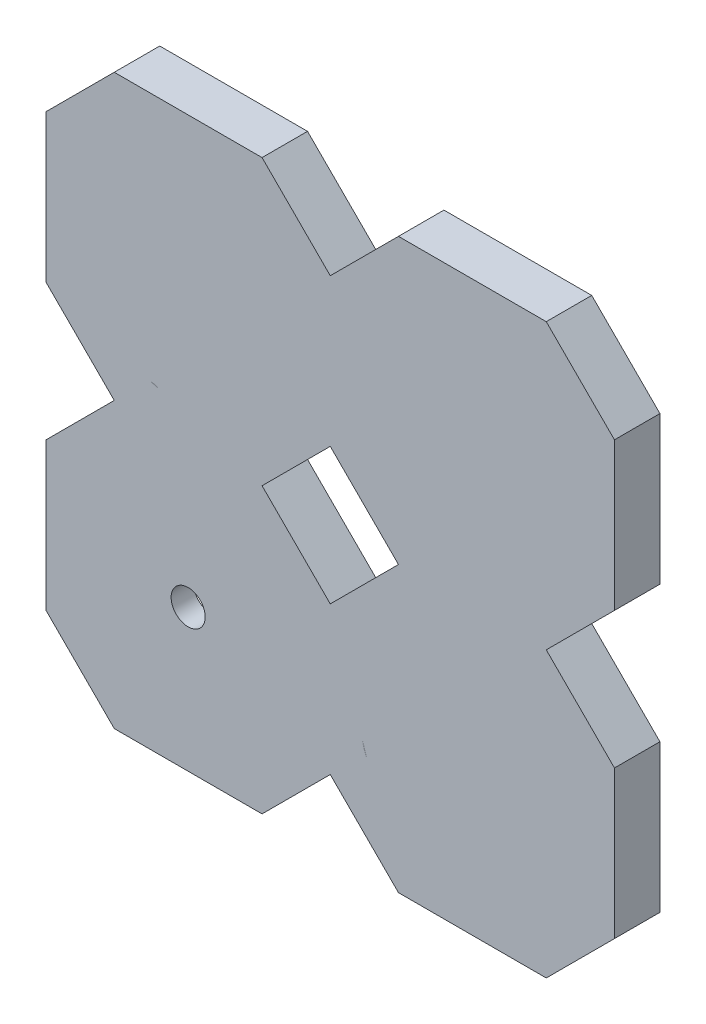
ISO-10303-21;
HEADER;
FILE_DESCRIPTION(('STEP AP214'),'2;1');
FILE_NAME('part.step','',(''),(''),'','','');
FILE_SCHEMA(('AUTOMOTIVE_DESIGN { 1 0 10303 214 1 1 1 1 }'));
ENDSEC;
DATA;
#1=APPLICATION_CONTEXT('core data for automotive mechanical design processes');
#2=APPLICATION_PROTOCOL_DEFINITION('international standard','automotive_design',2000,#1);
#3=PRODUCT_CONTEXT('',#1,'mechanical');
#4=PRODUCT('Part','Part','',(#3));
#5=PRODUCT_RELATED_PRODUCT_CATEGORY('part','',(#4));
#6=PRODUCT_DEFINITION_FORMATION('','',#4);
#7=PRODUCT_DEFINITION_CONTEXT('part definition',#1,'design');
#8=PRODUCT_DEFINITION('design','',#6,#7);
#9=PRODUCT_DEFINITION_SHAPE('','',#8);
#10=(LENGTH_UNIT() NAMED_UNIT(*) SI_UNIT(.MILLI.,.METRE.));
#11=(NAMED_UNIT(*) PLANE_ANGLE_UNIT() SI_UNIT($,.RADIAN.));
#12=(NAMED_UNIT(*) SI_UNIT($,.STERADIAN.) SOLID_ANGLE_UNIT());
#13=UNCERTAINTY_MEASURE_WITH_UNIT(LENGTH_MEASURE(1.E-05),#10,'distance_accuracy_value','');
#14=(GEOMETRIC_REPRESENTATION_CONTEXT(3) GLOBAL_UNCERTAINTY_ASSIGNED_CONTEXT((#13)) GLOBAL_UNIT_ASSIGNED_CONTEXT((#10,
#11,#12)) REPRESENTATION_CONTEXT('',''));
#15=CARTESIAN_POINT('',(0.,0.,0.));
#16=DIRECTION('',(0.,0.,1.));
#17=DIRECTION('',(1.,0.,0.));
#18=AXIS2_PLACEMENT_3D('',#15,#16,#17);
#19=CARTESIAN_POINT('',(112.5,308.5,-25.));
#20=DIRECTION('',(0.,0.,1.));
#21=DIRECTION('',(1.,0.,0.));
#22=AXIS2_PLACEMENT_3D('',#19,#20,#21);
#23=CYLINDRICAL_SURFACE('',#22,15.);
#24=CARTESIAN_POINT('',(112.5,308.5,0.));
#25=DIRECTION('',(0.,0.,1.));
#26=DIRECTION('',(1.,0.,0.));
#27=AXIS2_PLACEMENT_3D('',#24,#25,#26);
#28=CIRCLE('',#27,15.);
#29=CARTESIAN_POINT('',(127.5,308.5,0.));
#30=VERTEX_POINT('',#29);
#31=EDGE_CURVE('E50',#30,#30,#28,.F.);
#32=ORIENTED_EDGE('',*,*,#31,.F.);
#33=EDGE_LOOP('',(#32));
#34=FACE_BOUND('',#33,.T.);
#35=CARTESIAN_POINT('',(112.5,308.5,-20.));
#36=DIRECTION('',(0.,0.,-1.));
#37=DIRECTION('',(-1.,0.,0.));
#38=AXIS2_PLACEMENT_3D('',#35,#36,#37);
#39=CIRCLE('',#38,15.);
#40=CARTESIAN_POINT('',(97.4999999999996,308.5,-20.));
#41=VERTEX_POINT('',#40);
#42=EDGE_CURVE('E46',#41,#41,#39,.T.);
#43=ORIENTED_EDGE('',*,*,#42,.T.);
#44=EDGE_LOOP('',(#43));
#45=FACE_BOUND('',#44,.T.);
#46=ADVANCED_FACE('F42',(#34,#45),#23,.F.);
#47=CARTESIAN_POINT('',(112.5,308.5,-25.));
#48=DIRECTION('',(0.,0.,1.));
#49=DIRECTION('',(1.,0.,0.));
#50=AXIS2_PLACEMENT_3D('',#47,#48,#49);
#51=CYLINDRICAL_SURFACE('',#50,100.);
#52=CARTESIAN_POINT('',(112.5,308.5,-25.));
#53=DIRECTION('',(0.,0.,1.));
#54=DIRECTION('',(1.,0.,0.));
#55=AXIS2_PLACEMENT_3D('',#52,#53,#54);
#56=CIRCLE('',#55,100.);
#57=CARTESIAN_POINT('',(212.5,308.5,-25.));
#58=VERTEX_POINT('',#57);
#59=EDGE_CURVE('E11',#58,#58,#56,.F.);
#60=ORIENTED_EDGE('',*,*,#59,.F.);
#61=EDGE_LOOP('',(#60));
#62=FACE_BOUND('',#61,.T.);
#63=CARTESIAN_POINT('',(112.5,308.5,0.));
#64=DIRECTION('',(0.,0.,1.));
#65=DIRECTION('',(1.,0.,0.));
#66=AXIS2_PLACEMENT_3D('',#63,#64,#65);
#67=CIRCLE('',#66,100.);
#68=CARTESIAN_POINT('',(212.5,308.5,0.));
#69=VERTEX_POINT('',#68);
#70=EDGE_CURVE('E55',#69,#69,#67,.F.);
#71=ORIENTED_EDGE('',*,*,#70,.T.);
#72=EDGE_LOOP('',(#71));
#73=FACE_BOUND('',#72,.T.);
#74=ADVANCED_FACE('F44',(#62,#73),#51,.T.);
#75=CARTESIAN_POINT('',(0.,0.,-25.));
#76=DIRECTION('',(0.,0.,1.));
#77=DIRECTION('',(1.,0.,0.));
#78=AXIS2_PLACEMENT_3D('',#75,#76,#77);
#79=PLANE('',#78);
#80=CARTESIAN_POINT('',(112.5,308.5,-25.));
#81=DIRECTION('',(0.,0.,-1.));
#82=DIRECTION('',(-1.,0.,0.));
#83=AXIS2_PLACEMENT_3D('',#80,#81,#82);
#84=CIRCLE('',#83,65.);
#85=CARTESIAN_POINT('',(47.4999999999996,308.5,-25.));
#86=VERTEX_POINT('',#85);
#87=EDGE_CURVE('E58',#86,#86,#84,.T.);
#88=ORIENTED_EDGE('',*,*,#87,.F.);
#89=EDGE_LOOP('',(#88));
#90=FACE_BOUND('',#89,.T.);
#91=ORIENTED_EDGE('',*,*,#59,.T.);
#92=EDGE_LOOP('',(#91));
#93=FACE_BOUND('',#92,.T.);
#94=ADVANCED_FACE('F75',(#90,#93),#79,.F.);
#95=CARTESIAN_POINT('',(0.,0.,0.));
#96=DIRECTION('',(0.,0.,1.));
#97=DIRECTION('',(1.,0.,0.));
#98=AXIS2_PLACEMENT_3D('',#95,#96,#97);
#99=PLANE('',#98);
#100=ORIENTED_EDGE('',*,*,#70,.F.);
#101=EDGE_LOOP('',(#100));
#102=FACE_BOUND('',#101,.T.);
#103=ORIENTED_EDGE('',*,*,#31,.T.);
#104=EDGE_LOOP('',(#103));
#105=FACE_BOUND('',#104,.T.);
#106=ADVANCED_FACE('F77',(#102,#105),#99,.T.);
#107=CARTESIAN_POINT('',(112.5,308.5,-20.));
#108=DIRECTION('',(0.,0.,-1.));
#109=DIRECTION('',(-1.,0.,0.));
#110=AXIS2_PLACEMENT_3D('',#107,#108,#109);
#111=CYLINDRICAL_SURFACE('',#110,65.);
#112=CARTESIAN_POINT('',(112.5,308.5,-20.));
#113=DIRECTION('',(0.,0.,-1.));
#114=DIRECTION('',(-1.,0.,0.));
#115=AXIS2_PLACEMENT_3D('',#112,#113,#114);
#116=CIRCLE('',#115,65.);
#117=CARTESIAN_POINT('',(47.4999999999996,308.5,-20.));
#118=VERTEX_POINT('',#117);
#119=EDGE_CURVE('E64',#118,#118,#116,.T.);
#120=ORIENTED_EDGE('',*,*,#119,.F.);
#121=EDGE_LOOP('',(#120));
#122=FACE_BOUND('',#121,.T.);
#123=ORIENTED_EDGE('',*,*,#87,.T.);
#124=EDGE_LOOP('',(#123));
#125=FACE_BOUND('',#124,.T.);
#126=ADVANCED_FACE('F73',(#122,#125),#111,.F.);
#127=CARTESIAN_POINT('',(112.5,308.5,-20.));
#128=DIRECTION('',(0.,0.,-1.));
#129=DIRECTION('',(-1.,0.,0.));
#130=AXIS2_PLACEMENT_3D('',#127,#128,#129);
#131=PLANE('',#130);
#132=ORIENTED_EDGE('',*,*,#42,.F.);
#133=EDGE_LOOP('',(#132));
#134=FACE_BOUND('',#133,.T.);
#135=ORIENTED_EDGE('',*,*,#119,.T.);
#136=EDGE_LOOP('',(#135));
#137=FACE_BOUND('',#136,.T.);
#138=ADVANCED_FACE('F112',(#134,#137),#131,.T.);
#139=CLOSED_SHELL('',(#46,#74,#94,#106,#126,#138));
#140=MANIFOLD_SOLID_BREP('B2',#139);
#141=CARTESIAN_POINT('',(362.5,308.5,-25.));
#142=DIRECTION('',(0.,0.,1.));
#143=DIRECTION('',(1.,0.,0.));
#144=AXIS2_PLACEMENT_3D('',#141,#142,#143);
#145=CYLINDRICAL_SURFACE('',#144,15.);
#146=CARTESIAN_POINT('',(362.5,308.5,0.));
#147=DIRECTION('',(0.,0.,1.));
#148=DIRECTION('',(1.,0.,0.));
#149=AXIS2_PLACEMENT_3D('',#146,#147,#148);
#150=CIRCLE('',#149,15.);
#151=CARTESIAN_POINT('',(377.5,308.5,0.));
#152=VERTEX_POINT('',#151);
#153=EDGE_CURVE('E154',#152,#152,#150,.T.);
#154=ORIENTED_EDGE('',*,*,#153,.T.);
#155=EDGE_LOOP('',(#154));
#156=FACE_BOUND('',#155,.T.);
#157=CARTESIAN_POINT('',(362.5,308.5,-20.));
#158=DIRECTION('',(0.,0.,-1.));
#159=DIRECTION('',(-1.,0.,0.));
#160=AXIS2_PLACEMENT_3D('',#157,#158,#159);
#161=CIRCLE('',#160,15.);
#162=CARTESIAN_POINT('',(347.5,308.5,-20.));
#163=VERTEX_POINT('',#162);
#164=EDGE_CURVE('E145',#163,#163,#161,.F.);
#165=ORIENTED_EDGE('',*,*,#164,.F.);
#166=EDGE_LOOP('',(#165));
#167=FACE_BOUND('',#166,.T.);
#168=ADVANCED_FACE('F142',(#156,#167),#145,.F.);
#169=CARTESIAN_POINT('',(362.5,308.5,-25.));
#170=DIRECTION('',(0.,0.,1.));
#171=DIRECTION('',(1.,0.,0.));
#172=AXIS2_PLACEMENT_3D('',#169,#170,#171);
#173=CYLINDRICAL_SURFACE('',#172,100.);
#174=CARTESIAN_POINT('',(362.5,308.5,-25.));
#175=DIRECTION('',(0.,0.,1.));
#176=DIRECTION('',(1.,0.,0.));
#177=AXIS2_PLACEMENT_3D('',#174,#175,#176);
#178=CIRCLE('',#177,100.);
#179=CARTESIAN_POINT('',(462.5,308.5,-25.));
#180=VERTEX_POINT('',#179);
#181=EDGE_CURVE('E41',#180,#180,#178,.T.);
#182=ORIENTED_EDGE('',*,*,#181,.T.);
#183=EDGE_LOOP('',(#182));
#184=FACE_BOUND('',#183,.T.);
#185=CARTESIAN_POINT('',(362.5,308.5,0.));
#186=DIRECTION('',(0.,0.,1.));
#187=DIRECTION('',(1.,0.,0.));
#188=AXIS2_PLACEMENT_3D('',#185,#186,#187);
#189=CIRCLE('',#188,100.);
#190=CARTESIAN_POINT('',(462.5,308.5,0.));
#191=VERTEX_POINT('',#190);
#192=EDGE_CURVE('E149',#191,#191,#189,.T.);
#193=ORIENTED_EDGE('',*,*,#192,.F.);
#194=EDGE_LOOP('',(#193));
#195=FACE_BOUND('',#194,.T.);
#196=ADVANCED_FACE('F178',(#184,#195),#173,.T.);
#197=CARTESIAN_POINT('',(0.,0.,-25.));
#198=DIRECTION('',(0.,0.,1.));
#199=DIRECTION('',(1.,0.,0.));
#200=AXIS2_PLACEMENT_3D('',#197,#198,#199);
#201=PLANE('',#200);
#202=CARTESIAN_POINT('',(362.5,308.5,-25.));
#203=DIRECTION('',(0.,0.,-1.));
#204=DIRECTION('',(-1.,0.,0.));
#205=AXIS2_PLACEMENT_3D('',#202,#203,#204);
#206=CIRCLE('',#205,65.);
#207=CARTESIAN_POINT('',(297.5,308.5,-25.));
#208=VERTEX_POINT('',#207);
#209=EDGE_CURVE('E157',#208,#208,#206,.T.);
#210=ORIENTED_EDGE('',*,*,#209,.F.);
#211=EDGE_LOOP('',(#210));
#212=FACE_BOUND('',#211,.T.);
#213=ORIENTED_EDGE('',*,*,#181,.F.);
#214=EDGE_LOOP('',(#213));
#215=FACE_BOUND('',#214,.T.);
#216=ADVANCED_FACE('F174',(#212,#215),#201,.F.);
#217=CARTESIAN_POINT('',(0.,0.,0.));
#218=DIRECTION('',(0.,0.,1.));
#219=DIRECTION('',(1.,0.,0.));
#220=AXIS2_PLACEMENT_3D('',#217,#218,#219);
#221=PLANE('',#220);
#222=ORIENTED_EDGE('',*,*,#153,.F.);
#223=EDGE_LOOP('',(#222));
#224=FACE_BOUND('',#223,.T.);
#225=ORIENTED_EDGE('',*,*,#192,.T.);
#226=EDGE_LOOP('',(#225));
#227=FACE_BOUND('',#226,.T.);
#228=ADVANCED_FACE('F177',(#224,#227),#221,.T.);
#229=CARTESIAN_POINT('',(362.5,308.5,-20.));
#230=DIRECTION('',(0.,0.,-1.));
#231=DIRECTION('',(-1.,0.,0.));
#232=AXIS2_PLACEMENT_3D('',#229,#230,#231);
#233=PLANE('',#232);
#234=CARTESIAN_POINT('',(362.5,308.5,-20.));
#235=DIRECTION('',(0.,0.,-1.));
#236=DIRECTION('',(-1.,0.,0.));
#237=AXIS2_PLACEMENT_3D('',#234,#235,#236);
#238=CIRCLE('',#237,65.);
#239=CARTESIAN_POINT('',(297.5,308.5,-20.));
#240=VERTEX_POINT('',#239);
#241=EDGE_CURVE('E163',#240,#240,#238,.T.);
#242=ORIENTED_EDGE('',*,*,#241,.T.);
#243=EDGE_LOOP('',(#242));
#244=FACE_BOUND('',#243,.T.);
#245=ORIENTED_EDGE('',*,*,#164,.T.);
#246=EDGE_LOOP('',(#245));
#247=FACE_BOUND('',#246,.T.);
#248=ADVANCED_FACE('F184',(#244,#247),#233,.T.);
#249=CARTESIAN_POINT('',(362.5,308.5,-20.));
#250=DIRECTION('',(0.,0.,-1.));
#251=DIRECTION('',(-1.,0.,0.));
#252=AXIS2_PLACEMENT_3D('',#249,#250,#251);
#253=CYLINDRICAL_SURFACE('',#252,65.);
#254=ORIENTED_EDGE('',*,*,#241,.F.);
#255=EDGE_LOOP('',(#254));
#256=FACE_BOUND('',#255,.T.);
#257=ORIENTED_EDGE('',*,*,#209,.T.);
#258=EDGE_LOOP('',(#257));
#259=FACE_BOUND('',#258,.T.);
#260=ADVANCED_FACE('F172',(#256,#259),#253,.F.);
#261=CLOSED_SHELL('',(#168,#196,#216,#228,#248,#260));
#262=MANIFOLD_SOLID_BREP('B6',#261);
#263=CARTESIAN_POINT('',(362.5,58.4999999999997,-25.));
#264=DIRECTION('',(0.,0.,1.));
#265=DIRECTION('',(1.,0.,0.));
#266=AXIS2_PLACEMENT_3D('',#263,#264,#265);
#267=CYLINDRICAL_SURFACE('',#266,15.);
#268=CARTESIAN_POINT('',(362.5,58.4999999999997,0.));
#269=DIRECTION('',(0.,0.,1.));
#270=DIRECTION('',(1.,0.,0.));
#271=AXIS2_PLACEMENT_3D('',#268,#269,#270);
#272=CIRCLE('',#271,15.);
#273=CARTESIAN_POINT('',(377.5,58.4999999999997,0.));
#274=VERTEX_POINT('',#273);
#275=EDGE_CURVE('E251',#274,#274,#272,.F.);
#276=ORIENTED_EDGE('',*,*,#275,.F.);
#277=EDGE_LOOP('',(#276));
#278=FACE_BOUND('',#277,.T.);
#279=CARTESIAN_POINT('',(362.5,58.4999999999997,-20.));
#280=DIRECTION('',(0.,0.,-1.));
#281=DIRECTION('',(-1.,0.,0.));
#282=AXIS2_PLACEMENT_3D('',#279,#280,#281);
#283=CIRCLE('',#282,15.);
#284=CARTESIAN_POINT('',(347.5,58.4999999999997,-20.));
#285=VERTEX_POINT('',#284);
#286=EDGE_CURVE('E247',#285,#285,#283,.T.);
#287=ORIENTED_EDGE('',*,*,#286,.T.);
#288=EDGE_LOOP('',(#287));
#289=FACE_BOUND('',#288,.T.);
#290=ADVANCED_FACE('F243',(#278,#289),#267,.F.);
#291=CARTESIAN_POINT('',(362.5,58.4999999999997,-25.));
#292=DIRECTION('',(0.,0.,1.));
#293=DIRECTION('',(1.,0.,0.));
#294=AXIS2_PLACEMENT_3D('',#291,#292,#293);
#295=CYLINDRICAL_SURFACE('',#294,100.);
#296=CARTESIAN_POINT('',(362.5,58.4999999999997,-25.));
#297=DIRECTION('',(0.,0.,1.));
#298=DIRECTION('',(1.,0.,0.));
#299=AXIS2_PLACEMENT_3D('',#296,#297,#298);
#300=CIRCLE('',#299,100.);
#301=CARTESIAN_POINT('',(462.5,58.4999999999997,-25.));
#302=VERTEX_POINT('',#301);
#303=EDGE_CURVE('E141',#302,#302,#300,.F.);
#304=ORIENTED_EDGE('',*,*,#303,.F.);
#305=EDGE_LOOP('',(#304));
#306=FACE_BOUND('',#305,.T.);
#307=CARTESIAN_POINT('',(362.5,58.4999999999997,0.));
#308=DIRECTION('',(0.,0.,1.));
#309=DIRECTION('',(1.,0.,0.));
#310=AXIS2_PLACEMENT_3D('',#307,#308,#309);
#311=CIRCLE('',#310,100.);
#312=CARTESIAN_POINT('',(462.5,58.4999999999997,0.));
#313=VERTEX_POINT('',#312);
#314=EDGE_CURVE('E256',#313,#313,#311,.F.);
#315=ORIENTED_EDGE('',*,*,#314,.T.);
#316=EDGE_LOOP('',(#315));
#317=FACE_BOUND('',#316,.T.);
#318=ADVANCED_FACE('F245',(#306,#317),#295,.T.);
#319=CARTESIAN_POINT('',(0.,0.,-25.));
#320=DIRECTION('',(0.,0.,1.));
#321=DIRECTION('',(1.,0.,0.));
#322=AXIS2_PLACEMENT_3D('',#319,#320,#321);
#323=PLANE('',#322);
#324=CARTESIAN_POINT('',(362.5,58.4999999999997,-25.));
#325=DIRECTION('',(0.,0.,-1.));
#326=DIRECTION('',(-1.,0.,0.));
#327=AXIS2_PLACEMENT_3D('',#324,#325,#326);
#328=CIRCLE('',#327,65.);
#329=CARTESIAN_POINT('',(297.5,58.4999999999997,-25.));
#330=VERTEX_POINT('',#329);
#331=EDGE_CURVE('E259',#330,#330,#328,.T.);
#332=ORIENTED_EDGE('',*,*,#331,.F.);
#333=EDGE_LOOP('',(#332));
#334=FACE_BOUND('',#333,.T.);
#335=ORIENTED_EDGE('',*,*,#303,.T.);
#336=EDGE_LOOP('',(#335));
#337=FACE_BOUND('',#336,.T.);
#338=ADVANCED_FACE('F276',(#334,#337),#323,.F.);
#339=CARTESIAN_POINT('',(0.,0.,0.));
#340=DIRECTION('',(0.,0.,1.));
#341=DIRECTION('',(1.,0.,0.));
#342=AXIS2_PLACEMENT_3D('',#339,#340,#341);
#343=PLANE('',#342);
#344=ORIENTED_EDGE('',*,*,#314,.F.);
#345=EDGE_LOOP('',(#344));
#346=FACE_BOUND('',#345,.T.);
#347=ORIENTED_EDGE('',*,*,#275,.T.);
#348=EDGE_LOOP('',(#347));
#349=FACE_BOUND('',#348,.T.);
#350=ADVANCED_FACE('F278',(#346,#349),#343,.T.);
#351=CARTESIAN_POINT('',(362.5,58.4999999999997,-20.));
#352=DIRECTION('',(0.,0.,-1.));
#353=DIRECTION('',(-1.,0.,0.));
#354=AXIS2_PLACEMENT_3D('',#351,#352,#353);
#355=CYLINDRICAL_SURFACE('',#354,65.);
#356=CARTESIAN_POINT('',(362.5,58.4999999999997,-20.));
#357=DIRECTION('',(0.,0.,-1.));
#358=DIRECTION('',(-1.,0.,0.));
#359=AXIS2_PLACEMENT_3D('',#356,#357,#358);
#360=CIRCLE('',#359,65.);
#361=CARTESIAN_POINT('',(297.5,58.4999999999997,-20.));
#362=VERTEX_POINT('',#361);
#363=EDGE_CURVE('E265',#362,#362,#360,.T.);
#364=ORIENTED_EDGE('',*,*,#363,.F.);
#365=EDGE_LOOP('',(#364));
#366=FACE_BOUND('',#365,.T.);
#367=ORIENTED_EDGE('',*,*,#331,.T.);
#368=EDGE_LOOP('',(#367));
#369=FACE_BOUND('',#368,.T.);
#370=ADVANCED_FACE('F274',(#366,#369),#355,.F.);
#371=CARTESIAN_POINT('',(362.5,58.4999999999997,-20.));
#372=DIRECTION('',(0.,0.,-1.));
#373=DIRECTION('',(-1.,0.,0.));
#374=AXIS2_PLACEMENT_3D('',#371,#372,#373);
#375=PLANE('',#374);
#376=ORIENTED_EDGE('',*,*,#286,.F.);
#377=EDGE_LOOP('',(#376));
#378=FACE_BOUND('',#377,.T.);
#379=ORIENTED_EDGE('',*,*,#363,.T.);
#380=EDGE_LOOP('',(#379));
#381=FACE_BOUND('',#380,.T.);
#382=ADVANCED_FACE('F313',(#378,#381),#375,.T.);
#383=CLOSED_SHELL('',(#290,#318,#338,#350,#370,#382));
#384=MANIFOLD_SOLID_BREP('B36',#383);
#385=CARTESIAN_POINT('',(112.5,58.4999999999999,-25.));
#386=DIRECTION('',(0.,0.,1.));
#387=DIRECTION('',(1.,0.,0.));
#388=AXIS2_PLACEMENT_3D('',#385,#386,#387);
#389=CYLINDRICAL_SURFACE('',#388,15.);
#390=CARTESIAN_POINT('',(112.5,58.4999999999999,0.));
#391=DIRECTION('',(0.,0.,1.));
#392=DIRECTION('',(1.,0.,0.));
#393=AXIS2_PLACEMENT_3D('',#390,#391,#392);
#394=CIRCLE('',#393,15.);
#395=CARTESIAN_POINT('',(127.5,58.4999999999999,0.));
#396=VERTEX_POINT('',#395);
#397=EDGE_CURVE('E343',#396,#396,#394,.T.);
#398=ORIENTED_EDGE('',*,*,#397,.T.);
#399=EDGE_LOOP('',(#398));
#400=FACE_BOUND('',#399,.T.);
#401=CARTESIAN_POINT('',(112.5,58.4999999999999,-20.));
#402=DIRECTION('',(0.,0.,-1.));
#403=DIRECTION('',(-1.,0.,0.));
#404=AXIS2_PLACEMENT_3D('',#401,#402,#403);
#405=CIRCLE('',#404,15.);
#406=CARTESIAN_POINT('',(97.4999999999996,58.4999999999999,-20.));
#407=VERTEX_POINT('',#406);
#408=EDGE_CURVE('E338',#407,#407,#405,.F.);
#409=ORIENTED_EDGE('',*,*,#408,.F.);
#410=EDGE_LOOP('',(#409));
#411=FACE_BOUND('',#410,.T.);
#412=ADVANCED_FACE('F335',(#400,#411),#389,.F.);
#413=CARTESIAN_POINT('',(423.428932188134,423.428932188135,-40.));
#414=DIRECTION('',(0.707106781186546,0.707106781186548,0.));
#415=DIRECTION('',(-0.707106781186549,0.707106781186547,0.));
#416=AXIS2_PLACEMENT_3D('',#413,#414,#415);
#417=PLANE('',#416);
#418=DIRECTION('',(-0.707106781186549,0.707106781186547,0.));
#419=VECTOR('',#418,1.);
#420=CARTESIAN_POINT('',(477.499999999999,369.357864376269,-5.));
#421=LINE('',#420,#419);
#422=CARTESIAN_POINT('',(477.499999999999,369.357864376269,-5.));
#423=VERTEX_POINT('',#422);
#424=CARTESIAN_POINT('',(423.357864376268,423.5,-5.));
#425=VERTEX_POINT('',#424);
#426=EDGE_CURVE('E735',#423,#425,#421,.T.);
#427=ORIENTED_EDGE('',*,*,#426,.T.);
#428=DIRECTION('',(0.,0.,1.));
#429=VECTOR('',#428,1.);
#430=CARTESIAN_POINT('',(423.357864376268,423.5,-40.));
#431=LINE('',#430,#429);
#432=CARTESIAN_POINT('',(423.357864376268,423.5,-40.));
#433=VERTEX_POINT('',#432);
#434=EDGE_CURVE('E1042',#433,#425,#431,.T.);
#435=ORIENTED_EDGE('',*,*,#434,.F.);
#436=DIRECTION('',(-0.707106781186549,0.707106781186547,0.));
#437=VECTOR('',#436,1.);
#438=CARTESIAN_POINT('',(423.428932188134,423.428932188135,-40.));
#439=LINE('',#438,#437);
#440=CARTESIAN_POINT('',(477.499999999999,369.357864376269,-40.));
#441=VERTEX_POINT('',#440);
#442=EDGE_CURVE('E810',#441,#433,#439,.T.);
#443=ORIENTED_EDGE('',*,*,#442,.F.);
#444=DIRECTION('',(0.,0.,1.));
#445=VECTOR('',#444,1.);
#446=CARTESIAN_POINT('',(477.499999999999,369.357864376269,-40.));
#447=LINE('',#446,#445);
#448=EDGE_CURVE('E1062',#441,#423,#447,.T.);
#449=ORIENTED_EDGE('',*,*,#448,.T.);
#450=EDGE_LOOP('',(#427,#435,#443,#449));
#451=FACE_BOUND('',#450,.T.);
#452=ADVANCED_FACE('F1181',(#451),#417,.F.);
#453=CARTESIAN_POINT('',(-9.65732727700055E-13,423.499999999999,-40.));
#454=DIRECTION('',(0.,1.,0.));
#455=DIRECTION('',(-1.,0.,0.));
#456=AXIS2_PLACEMENT_3D('',#453,#454,#455);
#457=PLANE('',#456);
#458=DIRECTION('',(-1.,0.,0.));
#459=VECTOR('',#458,1.);
#460=CARTESIAN_POINT('',(423.357864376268,423.5,-5.));
#461=LINE('',#460,#459);
#462=CARTESIAN_POINT('',(301.642135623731,423.5,-5.));
#463=VERTEX_POINT('',#462);
#464=EDGE_CURVE('E733',#425,#463,#461,.T.);
#465=ORIENTED_EDGE('',*,*,#464,.T.);
#466=DIRECTION('',(0.,0.,1.));
#467=VECTOR('',#466,1.);
#468=CARTESIAN_POINT('',(301.642135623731,423.5,-40.));
#469=LINE('',#468,#467);
#470=CARTESIAN_POINT('',(301.642135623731,423.5,-40.));
#471=VERTEX_POINT('',#470);
#472=EDGE_CURVE('E1045',#471,#463,#469,.T.);
#473=ORIENTED_EDGE('',*,*,#472,.F.);
#474=DIRECTION('',(-1.,0.,0.));
#475=VECTOR('',#474,1.);
#476=CARTESIAN_POINT('',(-9.65732727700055E-13,423.499999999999,-40.));
#477=LINE('',#476,#475);
#478=EDGE_CURVE('E829',#433,#471,#477,.T.);
#479=ORIENTED_EDGE('',*,*,#478,.F.);
#480=ORIENTED_EDGE('',*,*,#434,.T.);
#481=EDGE_LOOP('',(#465,#473,#479,#480));
#482=FACE_BOUND('',#481,.T.);
#483=ADVANCED_FACE('F1185',(#482),#457,.F.);
#484=CARTESIAN_POINT('',(-60.9289321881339,60.9289321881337,-40.));
#485=DIRECTION('',(-0.707106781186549,0.707106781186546,0.));
#486=DIRECTION('',(-0.707106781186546,-0.707106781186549,0.));
#487=AXIS2_PLACEMENT_3D('',#484,#485,#486);
#488=PLANE('',#487);
#489=DIRECTION('',(-0.707106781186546,-0.707106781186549,0.));
#490=VECTOR('',#489,1.);
#491=CARTESIAN_POINT('',(301.642135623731,423.5,-5.));
#492=LINE('',#491,#490);
#493=CARTESIAN_POINT('',(247.5,369.357864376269,-5.));
#494=VERTEX_POINT('',#493);
#495=EDGE_CURVE('E731',#463,#494,#492,.T.);
#496=ORIENTED_EDGE('',*,*,#495,.T.);
#497=DIRECTION('',(0.,0.,1.));
#498=VECTOR('',#497,1.);
#499=CARTESIAN_POINT('',(247.5,369.357864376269,-40.));
#500=LINE('',#499,#498);
#501=CARTESIAN_POINT('',(247.5,369.357864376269,-40.));
#502=VERTEX_POINT('',#501);
#503=EDGE_CURVE('E1048',#502,#494,#500,.T.);
#504=ORIENTED_EDGE('',*,*,#503,.F.);
#505=DIRECTION('',(-0.707106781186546,-0.707106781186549,0.));
#506=VECTOR('',#505,1.);
#507=CARTESIAN_POINT('',(-60.9289321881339,60.9289321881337,-40.));
#508=LINE('',#507,#506);
#509=EDGE_CURVE('E827',#471,#502,#508,.T.);
#510=ORIENTED_EDGE('',*,*,#509,.F.);
#511=ORIENTED_EDGE('',*,*,#472,.T.);
#512=EDGE_LOOP('',(#496,#504,#510,#511));
#513=FACE_BOUND('',#512,.T.);
#514=ADVANCED_FACE('F1191',(#513),#488,.F.);
#515=CARTESIAN_POINT('',(247.5,5.64389256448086E-13,-40.));
#516=DIRECTION('',(1.,0.,0.));
#517=DIRECTION('',(0.,1.,0.));
#518=AXIS2_PLACEMENT_3D('',#515,#516,#517);
#519=PLANE('',#518);
#520=ORIENTED_EDGE('',*,*,#503,.T.);
#521=DIRECTION('',(0.,1.,0.));
#522=VECTOR('',#521,1.);
#523=CARTESIAN_POINT('',(247.5,247.642135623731,-5.));
#524=LINE('',#523,#522);
#525=CARTESIAN_POINT('',(247.5,247.642135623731,-5.));
#526=VERTEX_POINT('',#525);
#527=EDGE_CURVE('E728',#526,#494,#524,.T.);
#528=ORIENTED_EDGE('',*,*,#527,.F.);
#529=DIRECTION('',(0.,0.,1.));
#530=VECTOR('',#529,1.);
#531=CARTESIAN_POINT('',(247.5,247.642135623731,-40.));
#532=LINE('',#531,#530);
#533=CARTESIAN_POINT('',(247.5,247.642135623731,-40.));
#534=VERTEX_POINT('',#533);
#535=EDGE_CURVE('E1051',#534,#526,#532,.T.);
#536=ORIENTED_EDGE('',*,*,#535,.F.);
#537=DIRECTION('',(0.,1.,0.));
#538=VECTOR('',#537,1.);
#539=CARTESIAN_POINT('',(247.5,5.64389256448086E-13,-40.));
#540=LINE('',#539,#538);
#541=EDGE_CURVE('E824',#534,#502,#540,.T.);
#542=ORIENTED_EDGE('',*,*,#541,.T.);
#543=EDGE_LOOP('',(#520,#528,#536,#542));
#544=FACE_BOUND('',#543,.T.);
#545=ADVANCED_FACE('F1340',(#544),#519,.T.);
#546=CARTESIAN_POINT('',(247.571067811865,247.571067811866,-40.));
#547=DIRECTION('',(0.707106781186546,0.707106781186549,0.));
#548=DIRECTION('',(-0.707106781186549,0.707106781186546,0.));
#549=AXIS2_PLACEMENT_3D('',#546,#547,#548);
#550=PLANE('',#549);
#551=ORIENTED_EDGE('',*,*,#535,.T.);
#552=DIRECTION('',(-0.707106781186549,0.707106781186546,0.));
#553=VECTOR('',#552,1.);
#554=CARTESIAN_POINT('',(301.642135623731,193.5,-5.));
#555=LINE('',#554,#553);
#556=CARTESIAN_POINT('',(301.642135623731,193.5,-5.));
#557=VERTEX_POINT('',#556);
#558=EDGE_CURVE('E725',#557,#526,#555,.T.);
#559=ORIENTED_EDGE('',*,*,#558,.F.);
#560=DIRECTION('',(0.,0.,1.));
#561=VECTOR('',#560,1.);
#562=CARTESIAN_POINT('',(301.642135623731,193.5,-40.));
#563=LINE('',#562,#561);
#564=CARTESIAN_POINT('',(301.642135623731,193.5,-40.));
#565=VERTEX_POINT('',#564);
#566=EDGE_CURVE('E1054',#565,#557,#563,.T.);
#567=ORIENTED_EDGE('',*,*,#566,.F.);
#568=DIRECTION('',(-0.707106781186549,0.707106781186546,0.));
#569=VECTOR('',#568,1.);
#570=CARTESIAN_POINT('',(247.571067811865,247.571067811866,-40.));
#571=LINE('',#570,#569);
#572=EDGE_CURVE('E821',#565,#534,#571,.T.);
#573=ORIENTED_EDGE('',*,*,#572,.T.);
#574=EDGE_LOOP('',(#551,#559,#567,#573));
#575=FACE_BOUND('',#574,.T.);
#576=ADVANCED_FACE('F1344',(#575),#550,.T.);
#577=CARTESIAN_POINT('',(-3.9712480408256E-13,193.499999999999,-40.));
#578=DIRECTION('',(0.,1.,0.));
#579=DIRECTION('',(-1.,0.,0.));
#580=AXIS2_PLACEMENT_3D('',#577,#578,#579);
#581=PLANE('',#580);
#582=ORIENTED_EDGE('',*,*,#566,.T.);
#583=DIRECTION('',(-1.,0.,0.));
#584=VECTOR('',#583,1.);
#585=CARTESIAN_POINT('',(423.357864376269,193.5,-5.));
#586=LINE('',#585,#584);
#587=CARTESIAN_POINT('',(423.357864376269,193.5,-5.));
#588=VERTEX_POINT('',#587);
#589=EDGE_CURVE('E722',#588,#557,#586,.T.);
#590=ORIENTED_EDGE('',*,*,#589,.F.);
#591=DIRECTION('',(0.,0.,1.));
#592=VECTOR('',#591,1.);
#593=CARTESIAN_POINT('',(423.357864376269,193.5,-40.));
#594=LINE('',#593,#592);
#595=CARTESIAN_POINT('',(423.357864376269,193.5,-40.));
#596=VERTEX_POINT('',#595);
#597=EDGE_CURVE('E1057',#596,#588,#594,.T.);
#598=ORIENTED_EDGE('',*,*,#597,.F.);
#599=DIRECTION('',(-1.,0.,0.));
#600=VECTOR('',#599,1.);
#601=CARTESIAN_POINT('',(-3.9712480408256E-13,193.499999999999,-40.));
#602=LINE('',#601,#600);
#603=EDGE_CURVE('E818',#596,#565,#602,.T.);
#604=ORIENTED_EDGE('',*,*,#603,.T.);
#605=EDGE_LOOP('',(#582,#590,#598,#604));
#606=FACE_BOUND('',#605,.T.);
#607=ADVANCED_FACE('F1348',(#606),#581,.T.);
#608=CARTESIAN_POINT('',(114.928932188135,-114.928932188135,-40.));
#609=DIRECTION('',(-0.707106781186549,0.707106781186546,0.));
#610=DIRECTION('',(-0.707106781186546,-0.707106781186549,0.));
#611=AXIS2_PLACEMENT_3D('',#608,#609,#610);
#612=PLANE('',#611);
#613=ORIENTED_EDGE('',*,*,#597,.T.);
#614=DIRECTION('',(-0.707106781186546,-0.707106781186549,0.));
#615=VECTOR('',#614,1.);
#616=CARTESIAN_POINT('',(477.5,247.642135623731,-5.));
#617=LINE('',#616,#615);
#618=CARTESIAN_POINT('',(477.5,247.642135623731,-5.));
#619=VERTEX_POINT('',#618);
#620=EDGE_CURVE('E719',#619,#588,#617,.T.);
#621=ORIENTED_EDGE('',*,*,#620,.F.);
#622=DIRECTION('',(0.,0.,1.));
#623=VECTOR('',#622,1.);
#624=CARTESIAN_POINT('',(477.5,247.642135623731,-40.));
#625=LINE('',#624,#623);
#626=CARTESIAN_POINT('',(477.5,247.642135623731,-40.));
#627=VERTEX_POINT('',#626);
#628=EDGE_CURVE('E1060',#627,#619,#625,.T.);
#629=ORIENTED_EDGE('',*,*,#628,.F.);
#630=DIRECTION('',(-0.707106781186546,-0.707106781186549,0.));
#631=VECTOR('',#630,1.);
#632=CARTESIAN_POINT('',(114.928932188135,-114.928932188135,-40.));
#633=LINE('',#632,#631);
#634=EDGE_CURVE('E815',#627,#596,#633,.T.);
#635=ORIENTED_EDGE('',*,*,#634,.T.);
#636=EDGE_LOOP('',(#613,#621,#629,#635));
#637=FACE_BOUND('',#636,.T.);
#638=ADVANCED_FACE('F1291',(#637),#612,.T.);
#639=CARTESIAN_POINT('',(477.5,1.08887220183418E-12,-40.));
#640=DIRECTION('',(1.,0.,0.));
#641=DIRECTION('',(0.,1.,0.));
#642=AXIS2_PLACEMENT_3D('',#639,#640,#641);
#643=PLANE('',#642);
#644=DIRECTION('',(0.,1.,0.));
#645=VECTOR('',#644,1.);
#646=CARTESIAN_POINT('',(477.5,247.642135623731,-5.));
#647=LINE('',#646,#645);
#648=EDGE_CURVE('E717',#619,#423,#647,.T.);
#649=ORIENTED_EDGE('',*,*,#648,.T.);
#650=ORIENTED_EDGE('',*,*,#448,.F.);
#651=DIRECTION('',(0.,1.,0.));
#652=VECTOR('',#651,1.);
#653=CARTESIAN_POINT('',(477.5,1.08887220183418E-12,-40.));
#654=LINE('',#653,#652);
#655=EDGE_CURVE('E813',#627,#441,#654,.T.);
#656=ORIENTED_EDGE('',*,*,#655,.F.);
#657=ORIENTED_EDGE('',*,*,#628,.T.);
#658=EDGE_LOOP('',(#649,#650,#656,#657));
#659=FACE_BOUND('',#658,.T.);
#660=ADVANCED_FACE('F1196',(#659),#643,.F.);
#661=CARTESIAN_POINT('',(112.5,58.4999999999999,-25.));
#662=DIRECTION('',(0.,0.,1.));
#663=DIRECTION('',(1.,0.,0.));
#664=AXIS2_PLACEMENT_3D('',#661,#662,#663);
#665=CYLINDRICAL_SURFACE('',#664,100.);
#666=CARTESIAN_POINT('',(112.5,58.4999999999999,-25.));
#667=DIRECTION('',(0.,0.,1.));
#668=DIRECTION('',(1.,0.,0.));
#669=AXIS2_PLACEMENT_3D('',#666,#667,#668);
#670=CIRCLE('',#669,100.);
#671=CARTESIAN_POINT('',(212.5,58.4999999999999,-25.));
#672=VERTEX_POINT('',#671);
#673=EDGE_CURVE('E241',#672,#672,#670,.T.);
#674=ORIENTED_EDGE('',*,*,#673,.T.);
#675=EDGE_LOOP('',(#674));
#676=FACE_BOUND('',#675,.T.);
#677=CARTESIAN_POINT('',(112.5,58.4999999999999,-5.));
#678=DIRECTION('',(0.,0.,1.));
#679=DIRECTION('',(1.,0.,0.));
#680=AXIS2_PLACEMENT_3D('',#677,#678,#679);
#681=CIRCLE('',#680,100.);
#682=CARTESIAN_POINT('',(212.5,58.4999999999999,-5.));
#683=VERTEX_POINT('',#682);
#684=EDGE_CURVE('E973',#683,#683,#681,.T.);
#685=ORIENTED_EDGE('',*,*,#684,.F.);
#686=EDGE_LOOP('',(#685));
#687=FACE_BOUND('',#686,.T.);
#688=ADVANCED_FACE('F1284',(#676,#687),#665,.T.);
#689=CARTESIAN_POINT('',(0.,0.,-25.));
#690=DIRECTION('',(0.,0.,1.));
#691=DIRECTION('',(1.,0.,0.));
#692=AXIS2_PLACEMENT_3D('',#689,#690,#691);
#693=PLANE('',#692);
#694=CARTESIAN_POINT('',(112.5,58.4999999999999,-25.));
#695=DIRECTION('',(0.,0.,-1.));
#696=DIRECTION('',(-1.,0.,0.));
#697=AXIS2_PLACEMENT_3D('',#694,#695,#696);
#698=CIRCLE('',#697,65.);
#699=CARTESIAN_POINT('',(47.4999999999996,58.4999999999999,-25.));
#700=VERTEX_POINT('',#699);
#701=EDGE_CURVE('E1398',#700,#700,#698,.T.);
#702=ORIENTED_EDGE('',*,*,#701,.F.);
#703=EDGE_LOOP('',(#702));
#704=FACE_BOUND('',#703,.T.);
#705=ORIENTED_EDGE('',*,*,#673,.F.);
#706=EDGE_LOOP('',(#705));
#707=FACE_BOUND('',#706,.T.);
#708=ADVANCED_FACE('F1140',(#704,#707),#693,.F.);
#709=CARTESIAN_POINT('',(0.,0.,0.));
#710=DIRECTION('',(0.,0.,1.));
#711=DIRECTION('',(1.,0.,0.));
#712=AXIS2_PLACEMENT_3D('',#709,#710,#711);
#713=PLANE('',#712);
#714=ORIENTED_EDGE('',*,*,#397,.F.);
#715=EDGE_LOOP('',(#714));
#716=FACE_BOUND('',#715,.T.);
#717=DIRECTION('',(1.,0.,0.));
#718=VECTOR('',#717,1.);
#719=CARTESIAN_POINT('',(0.,433.5,0.));
#720=LINE('',#719,#718);
#721=CARTESIAN_POINT('',(47.4999999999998,433.5,0.));
#722=VERTEX_POINT('',#721);
#723=CARTESIAN_POINT('',(177.5,433.5,0.));
#724=VERTEX_POINT('',#723);
#725=EDGE_CURVE('E757',#722,#724,#720,.T.);
#726=ORIENTED_EDGE('',*,*,#725,.F.);
#727=DIRECTION('',(0.707106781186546,0.707106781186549,0.));
#728=VECTOR('',#727,1.);
#729=CARTESIAN_POINT('',(-193.,192.999999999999,0.));
#730=LINE('',#729,#728);
#731=CARTESIAN_POINT('',(-12.5,373.5,0.));
#732=VERTEX_POINT('',#731);
#733=EDGE_CURVE('E908',#732,#722,#730,.T.);
#734=ORIENTED_EDGE('',*,*,#733,.F.);
#735=DIRECTION('',(0.,1.,0.));
#736=VECTOR('',#735,1.);
#737=CARTESIAN_POINT('',(-12.5000000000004,0.,0.));
#738=LINE('',#737,#736);
#739=CARTESIAN_POINT('',(-12.5000000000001,243.5,0.));
#740=VERTEX_POINT('',#739);
#741=EDGE_CURVE('E910',#740,#732,#738,.T.);
#742=ORIENTED_EDGE('',*,*,#741,.F.);
#743=DIRECTION('',(0.707106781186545,-0.70710678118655,0.));
#744=VECTOR('',#743,1.);
#745=CARTESIAN_POINT('',(115.5,115.499999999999,0.));
#746=LINE('',#745,#744);
#747=CARTESIAN_POINT('',(47.4999999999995,183.5,0.));
#748=VERTEX_POINT('',#747);
#749=EDGE_CURVE('E912',#740,#748,#746,.T.);
#750=ORIENTED_EDGE('',*,*,#749,.T.);
#751=DIRECTION('',(0.707106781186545,0.70710678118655,0.));
#752=VECTOR('',#751,1.);
#753=CARTESIAN_POINT('',(-68.,67.9999999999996,0.));
#754=LINE('',#753,#752);
#755=CARTESIAN_POINT('',(-12.5000000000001,123.5,0.));
#756=VERTEX_POINT('',#755);
#757=EDGE_CURVE('E915',#756,#748,#754,.T.);
#758=ORIENTED_EDGE('',*,*,#757,.F.);
#759=DIRECTION('',(0.,-1.,0.));
#760=VECTOR('',#759,1.);
#761=CARTESIAN_POINT('',(-12.5,0.,0.));
#762=LINE('',#761,#760);
#763=CARTESIAN_POINT('',(-12.5,-6.49999999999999,0.));
#764=VERTEX_POINT('',#763);
#765=EDGE_CURVE('E918',#756,#764,#762,.T.);
#766=ORIENTED_EDGE('',*,*,#765,.T.);
#767=DIRECTION('',(0.707106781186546,-0.707106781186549,0.));
#768=VECTOR('',#767,1.);
#769=CARTESIAN_POINT('',(-9.5,-9.49999999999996,0.));
#770=LINE('',#769,#768);
#771=CARTESIAN_POINT('',(47.4999999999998,-66.5,0.));
#772=VERTEX_POINT('',#771);
#773=EDGE_CURVE('E921',#764,#772,#770,.T.);
#774=ORIENTED_EDGE('',*,*,#773,.T.);
#775=DIRECTION('',(1.,0.,0.));
#776=VECTOR('',#775,1.);
#777=CARTESIAN_POINT('',(0.,-66.5,0.));
#778=LINE('',#777,#776);
#779=CARTESIAN_POINT('',(177.5,-66.5,0.));
#780=VERTEX_POINT('',#779);
#781=EDGE_CURVE('E924',#772,#780,#778,.T.);
#782=ORIENTED_EDGE('',*,*,#781,.T.);
#783=DIRECTION('',(0.707106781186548,0.707106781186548,0.));
#784=VECTOR('',#783,1.);
#785=CARTESIAN_POINT('',(122.,-122.,0.));
#786=LINE('',#785,#784);
#787=CARTESIAN_POINT('',(237.5,-6.49999999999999,0.));
#788=VERTEX_POINT('',#787);
#789=EDGE_CURVE('E927',#780,#788,#786,.T.);
#790=ORIENTED_EDGE('',*,*,#789,.T.);
#791=DIRECTION('',(-0.707106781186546,0.707106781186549,0.));
#792=VECTOR('',#791,1.);
#793=CARTESIAN_POINT('',(115.5,115.5,0.));
#794=LINE('',#793,#792);
#795=CARTESIAN_POINT('',(297.5,-66.5000000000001,0.));
#796=VERTEX_POINT('',#795);
#797=EDGE_CURVE('E930',#796,#788,#794,.T.);
#798=ORIENTED_EDGE('',*,*,#797,.F.);
#799=DIRECTION('',(-1.,0.,0.));
#800=VECTOR('',#799,1.);
#801=CARTESIAN_POINT('',(-1.41980444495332E-13,-66.4999999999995,0.));
#802=LINE('',#801,#800);
#803=CARTESIAN_POINT('',(427.5,-66.5000000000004,0.));
#804=VERTEX_POINT('',#803);
#805=EDGE_CURVE('E933',#804,#796,#802,.T.);
#806=ORIENTED_EDGE('',*,*,#805,.F.);
#807=DIRECTION('',(-0.707106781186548,-0.707106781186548,0.));
#808=VECTOR('',#807,1.);
#809=CARTESIAN_POINT('',(247.,-247.,0.));
#810=LINE('',#809,#808);
#811=CARTESIAN_POINT('',(487.499999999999,-6.50000000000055,0.));
#812=VERTEX_POINT('',#811);
#813=EDGE_CURVE('E935',#812,#804,#810,.T.);
#814=ORIENTED_EDGE('',*,*,#813,.F.);
#815=DIRECTION('',(0.,-1.,0.));
#816=VECTOR('',#815,1.);
#817=CARTESIAN_POINT('',(487.499999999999,-1.66533453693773E-12,0.));
#818=LINE('',#817,#816);
#819=CARTESIAN_POINT('',(487.5,123.499999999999,0.));
#820=VERTEX_POINT('',#819);
#821=EDGE_CURVE('E937',#820,#812,#818,.T.);
#822=ORIENTED_EDGE('',*,*,#821,.F.);
#823=DIRECTION('',(-0.707106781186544,0.707106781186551,0.));
#824=VECTOR('',#823,1.);
#825=CARTESIAN_POINT('',(305.500000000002,305.499999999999,0.));
#826=LINE('',#825,#824);
#827=CARTESIAN_POINT('',(427.5,183.499999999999,0.));
#828=VERTEX_POINT('',#827);
#829=EDGE_CURVE('E939',#820,#828,#826,.T.);
#830=ORIENTED_EDGE('',*,*,#829,.T.);
#831=DIRECTION('',(-0.707106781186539,-0.707106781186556,0.));
#832=VECTOR('',#831,1.);
#833=CARTESIAN_POINT('',(122.000000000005,-122.000000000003,0.));
#834=LINE('',#833,#832);
#835=CARTESIAN_POINT('',(487.5,243.5,0.));
#836=VERTEX_POINT('',#835);
#837=EDGE_CURVE('E942',#836,#828,#834,.T.);
#838=ORIENTED_EDGE('',*,*,#837,.F.);
#839=DIRECTION('',(0.,1.,0.));
#840=VECTOR('',#839,1.);
#841=CARTESIAN_POINT('',(487.500000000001,1.66533453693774E-12,0.));
#842=LINE('',#841,#840);
#843=CARTESIAN_POINT('',(487.499999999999,373.5,0.));
#844=VERTEX_POINT('',#843);
#845=EDGE_CURVE('E945',#836,#844,#842,.T.);
#846=ORIENTED_EDGE('',*,*,#845,.T.);
#847=DIRECTION('',(-0.707106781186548,0.707106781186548,0.));
#848=VECTOR('',#847,1.);
#849=CARTESIAN_POINT('',(430.5,430.5,0.));
#850=LINE('',#849,#848);
#851=CARTESIAN_POINT('',(427.499999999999,433.5,0.));
#852=VERTEX_POINT('',#851);
#853=EDGE_CURVE('E948',#844,#852,#850,.T.);
#854=ORIENTED_EDGE('',*,*,#853,.T.);
#855=DIRECTION('',(-1.,0.,0.));
#856=VECTOR('',#855,1.);
#857=CARTESIAN_POINT('',(-9.25541694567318E-13,433.499999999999,0.));
#858=LINE('',#857,#856);
#859=CARTESIAN_POINT('',(297.5,433.5,0.));
#860=VERTEX_POINT('',#859);
#861=EDGE_CURVE('E951',#852,#860,#858,.T.);
#862=ORIENTED_EDGE('',*,*,#861,.T.);
#863=DIRECTION('',(-0.707106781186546,-0.707106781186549,0.));
#864=VECTOR('',#863,1.);
#865=CARTESIAN_POINT('',(-67.9999999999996,67.9999999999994,0.));
#866=LINE('',#865,#864);
#867=CARTESIAN_POINT('',(237.5,373.5,0.));
#868=VERTEX_POINT('',#867);
#869=EDGE_CURVE('E954',#860,#868,#866,.T.);
#870=ORIENTED_EDGE('',*,*,#869,.T.);
#871=DIRECTION('',(0.707106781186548,-0.707106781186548,0.));
#872=VECTOR('',#871,1.);
#873=CARTESIAN_POINT('',(305.5,305.5,0.));
#874=LINE('',#873,#872);
#875=EDGE_CURVE('E957',#724,#868,#874,.T.);
#876=ORIENTED_EDGE('',*,*,#875,.F.);
#877=EDGE_LOOP('',(#726,#734,#742,#750,#758,#766,#774,#782,#790,#798,#806,#814,#822,#830,#838,
#846,#854,#862,#870,#876));
#878=FACE_BOUND('',#877,.T.);
#879=DIRECTION('',(0.707106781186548,-0.707106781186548,0.));
#880=VECTOR('',#879,1.);
#881=CARTESIAN_POINT('',(180.5,180.5,0.));
#882=LINE('',#881,#880);
#883=CARTESIAN_POINT('',(177.5,183.5,0.));
#884=VERTEX_POINT('',#883);
#885=CARTESIAN_POINT('',(237.5,123.5,0.));
#886=VERTEX_POINT('',#885);
#887=EDGE_CURVE('E960',#884,#886,#882,.T.);
#888=ORIENTED_EDGE('',*,*,#887,.F.);
#889=DIRECTION('',(0.707106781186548,0.707106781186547,0.));
#890=VECTOR('',#889,1.);
#891=CARTESIAN_POINT('',(-3.00000000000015,3.00000000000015,0.));
#892=LINE('',#891,#890);
#893=CARTESIAN_POINT('',(237.5,243.5,0.));
#894=VERTEX_POINT('',#893);
#895=EDGE_CURVE('E963',#884,#894,#892,.T.);
#896=ORIENTED_EDGE('',*,*,#895,.T.);
#897=DIRECTION('',(-0.707106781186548,0.707106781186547,0.));
#898=VECTOR('',#897,1.);
#899=CARTESIAN_POINT('',(240.5,240.5,0.));
#900=LINE('',#899,#898);
#901=CARTESIAN_POINT('',(297.5,183.5,0.));
#902=VERTEX_POINT('',#901);
#903=EDGE_CURVE('E966',#902,#894,#900,.T.);
#904=ORIENTED_EDGE('',*,*,#903,.F.);
#905=DIRECTION('',(-0.707106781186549,-0.707106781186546,0.));
#906=VECTOR('',#905,1.);
#907=CARTESIAN_POINT('',(56.9999999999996,-56.9999999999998,0.));
#908=LINE('',#907,#906);
#909=EDGE_CURVE('E762',#902,#886,#908,.T.);
#910=ORIENTED_EDGE('',*,*,#909,.T.);
#911=EDGE_LOOP('',(#888,#896,#904,#910));
#912=FACE_BOUND('',#911,.T.);
#913=ADVANCED_FACE('F1136',(#716,#878,#912),#713,.T.);
#914=CARTESIAN_POINT('',(0.,0.,-5.));
#915=DIRECTION('',(0.,0.,1.));
#916=DIRECTION('',(1.,0.,0.));
#917=AXIS2_PLACEMENT_3D('',#914,#915,#916);
#918=PLANE('',#917);
#919=ORIENTED_EDGE('',*,*,#684,.T.);
#920=EDGE_LOOP('',(#919));
#921=FACE_BOUND('',#920,.T.);
#922=DIRECTION('',(0.,-1.,0.));
#923=VECTOR('',#922,1.);
#924=CARTESIAN_POINT('',(-2.50000000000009,0.,-5.));
#925=LINE('',#924,#923);
#926=CARTESIAN_POINT('',(-2.50000000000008,119.357864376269,-5.));
#927=VERTEX_POINT('',#926);
#928=CARTESIAN_POINT('',(-2.50000000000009,-2.3578643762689,-5.));
#929=VERTEX_POINT('',#928);
#930=EDGE_CURVE('E1112',#927,#929,#925,.T.);
#931=ORIENTED_EDGE('',*,*,#930,.F.);
#932=DIRECTION('',(0.707106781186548,0.707106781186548,0.));
#933=VECTOR('',#932,1.);
#934=CARTESIAN_POINT('',(-60.9289321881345,60.9289321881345,-5.));
#935=LINE('',#934,#933);
#936=CARTESIAN_POINT('',(51.6421356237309,173.5,-5.));
#937=VERTEX_POINT('',#936);
#938=EDGE_CURVE('E1130',#927,#937,#935,.T.);
#939=ORIENTED_EDGE('',*,*,#938,.T.);
#940=DIRECTION('',(1.,0.,0.));
#941=VECTOR('',#940,1.);
#942=CARTESIAN_POINT('',(0.,173.5,-5.));
#943=LINE('',#942,#941);
#944=CARTESIAN_POINT('',(173.357864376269,173.5,-5.));
#945=VERTEX_POINT('',#944);
#946=EDGE_CURVE('E1128',#937,#945,#943,.T.);
#947=ORIENTED_EDGE('',*,*,#946,.T.);
#948=DIRECTION('',(0.707106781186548,-0.707106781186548,0.));
#949=VECTOR('',#948,1.);
#950=CARTESIAN_POINT('',(173.428932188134,173.428932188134,-5.));
#951=LINE('',#950,#949);
#952=CARTESIAN_POINT('',(227.5,119.357864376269,-5.));
#953=VERTEX_POINT('',#952);
#954=EDGE_CURVE('E1126',#945,#953,#951,.T.);
#955=ORIENTED_EDGE('',*,*,#954,.T.);
#956=DIRECTION('',(0.,-1.,0.));
#957=VECTOR('',#956,1.);
#958=CARTESIAN_POINT('',(227.5,0.,-5.));
#959=LINE('',#958,#957);
#960=CARTESIAN_POINT('',(227.5,-2.35786437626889,-5.));
#961=VERTEX_POINT('',#960);
#962=EDGE_CURVE('E1124',#953,#961,#959,.T.);
#963=ORIENTED_EDGE('',*,*,#962,.T.);
#964=DIRECTION('',(0.707106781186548,0.707106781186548,0.));
#965=VECTOR('',#964,1.);
#966=CARTESIAN_POINT('',(114.928932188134,-114.928932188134,-5.));
#967=LINE('',#966,#965);
#968=CARTESIAN_POINT('',(173.357864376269,-56.5,-5.));
#969=VERTEX_POINT('',#968);
#970=EDGE_CURVE('E1121',#969,#961,#967,.T.);
#971=ORIENTED_EDGE('',*,*,#970,.F.);
#972=DIRECTION('',(1.,0.,0.));
#973=VECTOR('',#972,1.);
#974=CARTESIAN_POINT('',(0.,-56.5,-5.));
#975=LINE('',#974,#973);
#976=CARTESIAN_POINT('',(51.642135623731,-56.5,-5.));
#977=VERTEX_POINT('',#976);
#978=EDGE_CURVE('E1118',#977,#969,#975,.T.);
#979=ORIENTED_EDGE('',*,*,#978,.F.);
#980=DIRECTION('',(0.707106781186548,-0.707106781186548,0.));
#981=VECTOR('',#980,1.);
#982=CARTESIAN_POINT('',(-2.4289321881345,-2.4289321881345,-5.));
#983=LINE('',#982,#981);
#984=EDGE_CURVE('E1115',#929,#977,#983,.T.);
#985=ORIENTED_EDGE('',*,*,#984,.F.);
#986=EDGE_LOOP('',(#931,#939,#947,#955,#963,#971,#979,#985));
#987=FACE_BOUND('',#986,.T.);
#988=ADVANCED_FACE('F1139',(#921,#987),#918,.F.);
#989=CARTESIAN_POINT('',(-2.4289321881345,-2.4289321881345,-40.));
#990=DIRECTION('',(-0.707106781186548,-0.707106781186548,0.));
#991=DIRECTION('',(0.707106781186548,-0.707106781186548,0.));
#992=AXIS2_PLACEMENT_3D('',#989,#990,#991);
#993=PLANE('',#992);
#994=DIRECTION('',(0.,0.,1.));
#995=VECTOR('',#994,1.);
#996=CARTESIAN_POINT('',(-2.50000000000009,-2.3578643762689,-40.));
#997=LINE('',#996,#995);
#998=CARTESIAN_POINT('',(-2.50000000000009,-2.3578643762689,-40.));
#999=VERTEX_POINT('',#998);
#1000=EDGE_CURVE('E1039',#999,#929,#997,.T.);
#1001=ORIENTED_EDGE('',*,*,#1000,.T.);
#1002=ORIENTED_EDGE('',*,*,#984,.T.);
#1003=DIRECTION('',(0.,0.,1.));
#1004=VECTOR('',#1003,1.);
#1005=CARTESIAN_POINT('',(51.642135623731,-56.5,-40.));
#1006=LINE('',#1005,#1004);
#1007=CARTESIAN_POINT('',(51.642135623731,-56.5,-40.));
#1008=VERTEX_POINT('',#1007);
#1009=EDGE_CURVE('E1018',#1008,#977,#1006,.T.);
#1010=ORIENTED_EDGE('',*,*,#1009,.F.);
#1011=DIRECTION('',(0.707106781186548,-0.707106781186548,0.));
#1012=VECTOR('',#1011,1.);
#1013=CARTESIAN_POINT('',(-2.4289321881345,-2.4289321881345,-40.));
#1014=LINE('',#1013,#1012);
#1015=EDGE_CURVE('E831',#999,#1008,#1014,.T.);
#1016=ORIENTED_EDGE('',*,*,#1015,.F.);
#1017=EDGE_LOOP('',(#1001,#1002,#1010,#1016));
#1018=FACE_BOUND('',#1017,.T.);
#1019=ADVANCED_FACE('F1281',(#1018),#993,.F.);
#1020=CARTESIAN_POINT('',(0.,-56.5,-40.));
#1021=DIRECTION('',(0.,-1.,0.));
#1022=DIRECTION('',(0.,0.,-1.));
#1023=AXIS2_PLACEMENT_3D('',#1020,#1021,#1022);
#1024=PLANE('',#1023);
#1025=ORIENTED_EDGE('',*,*,#1009,.T.);
#1026=ORIENTED_EDGE('',*,*,#978,.T.);
#1027=DIRECTION('',(0.,0.,1.));
#1028=VECTOR('',#1027,1.);
#1029=CARTESIAN_POINT('',(173.357864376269,-56.5,-40.));
#1030=LINE('',#1029,#1028);
#1031=CARTESIAN_POINT('',(173.357864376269,-56.5,-40.));
#1032=VERTEX_POINT('',#1031);
#1033=EDGE_CURVE('E1021',#1032,#969,#1030,.T.);
#1034=ORIENTED_EDGE('',*,*,#1033,.F.);
#1035=DIRECTION('',(1.,0.,0.));
#1036=VECTOR('',#1035,1.);
#1037=CARTESIAN_POINT('',(0.,-56.5,-40.));
#1038=LINE('',#1037,#1036);
#1039=EDGE_CURVE('E850',#1008,#1032,#1038,.T.);
#1040=ORIENTED_EDGE('',*,*,#1039,.F.);
#1041=EDGE_LOOP('',(#1025,#1026,#1034,#1040));
#1042=FACE_BOUND('',#1041,.T.);
#1043=ADVANCED_FACE('F1326',(#1042),#1024,.F.);
#1044=CARTESIAN_POINT('',(114.928932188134,-114.928932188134,-40.));
#1045=DIRECTION('',(0.707106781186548,-0.707106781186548,0.));
#1046=DIRECTION('',(0.707106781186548,0.707106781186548,0.));
#1047=AXIS2_PLACEMENT_3D('',#1044,#1045,#1046);
#1048=PLANE('',#1047);
#1049=ORIENTED_EDGE('',*,*,#1033,.T.);
#1050=ORIENTED_EDGE('',*,*,#970,.T.);
#1051=DIRECTION('',(0.,0.,1.));
#1052=VECTOR('',#1051,1.);
#1053=CARTESIAN_POINT('',(227.5,-2.35786437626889,-40.));
#1054=LINE('',#1053,#1052);
#1055=CARTESIAN_POINT('',(227.5,-2.35786437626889,-40.));
#1056=VERTEX_POINT('',#1055);
#1057=EDGE_CURVE('E1024',#1056,#961,#1054,.T.);
#1058=ORIENTED_EDGE('',*,*,#1057,.F.);
#1059=DIRECTION('',(0.707106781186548,0.707106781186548,0.));
#1060=VECTOR('',#1059,1.);
#1061=CARTESIAN_POINT('',(114.928932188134,-114.928932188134,-40.));
#1062=LINE('',#1061,#1060);
#1063=EDGE_CURVE('E848',#1032,#1056,#1062,.T.);
#1064=ORIENTED_EDGE('',*,*,#1063,.F.);
#1065=EDGE_LOOP('',(#1049,#1050,#1058,#1064));
#1066=FACE_BOUND('',#1065,.T.);
#1067=ADVANCED_FACE('F1324',(#1066),#1048,.F.);
#1068=CARTESIAN_POINT('',(227.5,0.,-40.));
#1069=DIRECTION('',(-1.,0.,0.));
#1070=DIRECTION('',(0.,0.,1.));
#1071=AXIS2_PLACEMENT_3D('',#1068,#1069,#1070);
#1072=PLANE('',#1071);
#1073=ORIENTED_EDGE('',*,*,#962,.F.);
#1074=DIRECTION('',(0.,0.,1.));
#1075=VECTOR('',#1074,1.);
#1076=CARTESIAN_POINT('',(227.5,119.357864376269,-40.));
#1077=LINE('',#1076,#1075);
#1078=CARTESIAN_POINT('',(227.5,119.357864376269,-40.));
#1079=VERTEX_POINT('',#1078);
#1080=EDGE_CURVE('E1027',#1079,#953,#1077,.T.);
#1081=ORIENTED_EDGE('',*,*,#1080,.F.);
#1082=DIRECTION('',(0.,-1.,0.));
#1083=VECTOR('',#1082,1.);
#1084=CARTESIAN_POINT('',(227.5,0.,-40.));
#1085=LINE('',#1084,#1083);
#1086=EDGE_CURVE('E845',#1079,#1056,#1085,.T.);
#1087=ORIENTED_EDGE('',*,*,#1086,.T.);
#1088=ORIENTED_EDGE('',*,*,#1057,.T.);
#1089=EDGE_LOOP('',(#1073,#1081,#1087,#1088));
#1090=FACE_BOUND('',#1089,.T.);
#1091=ADVANCED_FACE('F1319',(#1090),#1072,.T.);
#1092=CARTESIAN_POINT('',(173.428932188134,173.428932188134,-40.));
#1093=DIRECTION('',(-0.707106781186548,-0.707106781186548,0.));
#1094=DIRECTION('',(0.707106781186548,-0.707106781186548,0.));
#1095=AXIS2_PLACEMENT_3D('',#1092,#1093,#1094);
#1096=PLANE('',#1095);
#1097=ORIENTED_EDGE('',*,*,#954,.F.);
#1098=DIRECTION('',(0.,0.,1.));
#1099=VECTOR('',#1098,1.);
#1100=CARTESIAN_POINT('',(173.357864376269,173.5,-40.));
#1101=LINE('',#1100,#1099);
#1102=CARTESIAN_POINT('',(173.357864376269,173.5,-40.));
#1103=VERTEX_POINT('',#1102);
#1104=EDGE_CURVE('E1030',#1103,#945,#1101,.T.);
#1105=ORIENTED_EDGE('',*,*,#1104,.F.);
#1106=DIRECTION('',(0.707106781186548,-0.707106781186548,0.));
#1107=VECTOR('',#1106,1.);
#1108=CARTESIAN_POINT('',(173.428932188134,173.428932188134,-40.));
#1109=LINE('',#1108,#1107);
#1110=EDGE_CURVE('E842',#1103,#1079,#1109,.T.);
#1111=ORIENTED_EDGE('',*,*,#1110,.T.);
#1112=ORIENTED_EDGE('',*,*,#1080,.T.);
#1113=EDGE_LOOP('',(#1097,#1105,#1111,#1112));
#1114=FACE_BOUND('',#1113,.T.);
#1115=ADVANCED_FACE('F1317',(#1114),#1096,.T.);
#1116=CARTESIAN_POINT('',(0.,173.5,-40.));
#1117=DIRECTION('',(0.,-1.,0.));
#1118=DIRECTION('',(0.,0.,-1.));
#1119=AXIS2_PLACEMENT_3D('',#1116,#1117,#1118);
#1120=PLANE('',#1119);
#1121=ORIENTED_EDGE('',*,*,#946,.F.);
#1122=DIRECTION('',(0.,0.,1.));
#1123=VECTOR('',#1122,1.);
#1124=CARTESIAN_POINT('',(51.6421356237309,173.5,-40.));
#1125=LINE('',#1124,#1123);
#1126=CARTESIAN_POINT('',(51.6421356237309,173.5,-40.));
#1127=VERTEX_POINT('',#1126);
#1128=EDGE_CURVE('E1033',#1127,#937,#1125,.T.);
#1129=ORIENTED_EDGE('',*,*,#1128,.F.);
#1130=DIRECTION('',(1.,0.,0.));
#1131=VECTOR('',#1130,1.);
#1132=CARTESIAN_POINT('',(0.,173.5,-40.));
#1133=LINE('',#1132,#1131);
#1134=EDGE_CURVE('E839',#1127,#1103,#1133,.T.);
#1135=ORIENTED_EDGE('',*,*,#1134,.T.);
#1136=ORIENTED_EDGE('',*,*,#1104,.T.);
#1137=EDGE_LOOP('',(#1121,#1129,#1135,#1136));
#1138=FACE_BOUND('',#1137,.T.);
#1139=ADVANCED_FACE('F1313',(#1138),#1120,.T.);
#1140=CARTESIAN_POINT('',(-60.9289321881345,60.9289321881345,-40.));
#1141=DIRECTION('',(0.707106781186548,-0.707106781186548,0.));
#1142=DIRECTION('',(0.707106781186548,0.707106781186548,0.));
#1143=AXIS2_PLACEMENT_3D('',#1140,#1141,#1142);
#1144=PLANE('',#1143);
#1145=ORIENTED_EDGE('',*,*,#938,.F.);
#1146=DIRECTION('',(0.,0.,1.));
#1147=VECTOR('',#1146,1.);
#1148=CARTESIAN_POINT('',(-2.50000000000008,119.357864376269,-40.));
#1149=LINE('',#1148,#1147);
#1150=CARTESIAN_POINT('',(-2.50000000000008,119.357864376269,-40.));
#1151=VERTEX_POINT('',#1150);
#1152=EDGE_CURVE('E1036',#1151,#927,#1149,.T.);
#1153=ORIENTED_EDGE('',*,*,#1152,.F.);
#1154=DIRECTION('',(0.707106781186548,0.707106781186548,0.));
#1155=VECTOR('',#1154,1.);
#1156=CARTESIAN_POINT('',(-60.9289321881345,60.9289321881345,-40.));
#1157=LINE('',#1156,#1155);
#1158=EDGE_CURVE('E836',#1151,#1127,#1157,.T.);
#1159=ORIENTED_EDGE('',*,*,#1158,.T.);
#1160=ORIENTED_EDGE('',*,*,#1128,.T.);
#1161=EDGE_LOOP('',(#1145,#1153,#1159,#1160));
#1162=FACE_BOUND('',#1161,.T.);
#1163=ADVANCED_FACE('F1302',(#1162),#1144,.T.);
#1164=CARTESIAN_POINT('',(-2.50000000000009,0.,-40.));
#1165=DIRECTION('',(-1.,0.,0.));
#1166=DIRECTION('',(0.,0.,1.));
#1167=AXIS2_PLACEMENT_3D('',#1164,#1165,#1166);
#1168=PLANE('',#1167);
#1169=ORIENTED_EDGE('',*,*,#1152,.T.);
#1170=ORIENTED_EDGE('',*,*,#930,.T.);
#1171=ORIENTED_EDGE('',*,*,#1000,.F.);
#1172=DIRECTION('',(0.,-1.,0.));
#1173=VECTOR('',#1172,1.);
#1174=CARTESIAN_POINT('',(-2.50000000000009,0.,-40.));
#1175=LINE('',#1174,#1173);
#1176=EDGE_CURVE('E834',#1151,#999,#1175,.T.);
#1177=ORIENTED_EDGE('',*,*,#1176,.F.);
#1178=EDGE_LOOP('',(#1169,#1170,#1171,#1177));
#1179=FACE_BOUND('',#1178,.T.);
#1180=ADVANCED_FACE('F1304',(#1179),#1168,.F.);
#1181=CARTESIAN_POINT('',(180.5,180.5,-40.));
#1182=DIRECTION('',(-0.707106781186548,-0.707106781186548,0.));
#1183=DIRECTION('',(0.707106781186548,-0.707106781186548,0.));
#1184=AXIS2_PLACEMENT_3D('',#1181,#1182,#1183);
#1185=PLANE('',#1184);
#1186=ORIENTED_EDGE('',*,*,#887,.T.);
#1187=DIRECTION('',(0.,0.,1.));
#1188=VECTOR('',#1187,1.);
#1189=CARTESIAN_POINT('',(237.5,123.5,-40.));
#1190=LINE('',#1189,#1188);
#1191=CARTESIAN_POINT('',(237.5,123.5,-40.));
#1192=VERTEX_POINT('',#1191);
#1193=EDGE_CURVE('E971',#1192,#886,#1190,.T.);
#1194=ORIENTED_EDGE('',*,*,#1193,.F.);
#1195=DIRECTION('',(0.707106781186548,-0.707106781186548,0.));
#1196=VECTOR('',#1195,1.);
#1197=CARTESIAN_POINT('',(180.5,180.5,-40.));
#1198=LINE('',#1197,#1196);
#1199=CARTESIAN_POINT('',(177.5,183.5,-40.));
#1200=VERTEX_POINT('',#1199);
#1201=EDGE_CURVE('E895',#1200,#1192,#1198,.T.);
#1202=ORIENTED_EDGE('',*,*,#1201,.F.);
#1203=DIRECTION('',(0.,0.,1.));
#1204=VECTOR('',#1203,1.);
#1205=CARTESIAN_POINT('',(177.5,183.5,-40.));
#1206=LINE('',#1205,#1204);
#1207=EDGE_CURVE('E978',#1200,#884,#1206,.T.);
#1208=ORIENTED_EDGE('',*,*,#1207,.T.);
#1209=EDGE_LOOP('',(#1186,#1194,#1202,#1208));
#1210=FACE_BOUND('',#1209,.T.);
#1211=ADVANCED_FACE('F1162',(#1210),#1185,.F.);
#1212=CARTESIAN_POINT('',(56.9999999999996,-56.9999999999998,-40.));
#1213=DIRECTION('',(-0.707106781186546,0.707106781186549,0.));
#1214=DIRECTION('',(-0.707106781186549,-0.707106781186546,0.));
#1215=AXIS2_PLACEMENT_3D('',#1212,#1213,#1214);
#1216=PLANE('',#1215);
#1217=ORIENTED_EDGE('',*,*,#909,.F.);
#1218=DIRECTION('',(0.,0.,1.));
#1219=VECTOR('',#1218,1.);
#1220=CARTESIAN_POINT('',(297.5,183.5,-40.));
#1221=LINE('',#1220,#1219);
#1222=CARTESIAN_POINT('',(297.5,183.5,-40.));
#1223=VERTEX_POINT('',#1222);
#1224=EDGE_CURVE('E974',#1223,#902,#1221,.T.);
#1225=ORIENTED_EDGE('',*,*,#1224,.F.);
#1226=DIRECTION('',(-0.707106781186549,-0.707106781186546,0.));
#1227=VECTOR('',#1226,1.);
#1228=CARTESIAN_POINT('',(56.9999999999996,-56.9999999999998,-40.));
#1229=LINE('',#1228,#1227);
#1230=EDGE_CURVE('E902',#1223,#1192,#1229,.T.);
#1231=ORIENTED_EDGE('',*,*,#1230,.T.);
#1232=ORIENTED_EDGE('',*,*,#1193,.T.);
#1233=EDGE_LOOP('',(#1217,#1225,#1231,#1232));
#1234=FACE_BOUND('',#1233,.T.);
#1235=ADVANCED_FACE('F1160',(#1234),#1216,.T.);
#1236=CARTESIAN_POINT('',(240.5,240.5,-40.));
#1237=DIRECTION('',(0.707106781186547,0.707106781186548,0.));
#1238=DIRECTION('',(-0.707106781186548,0.707106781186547,0.));
#1239=AXIS2_PLACEMENT_3D('',#1236,#1237,#1238);
#1240=PLANE('',#1239);
#1241=ORIENTED_EDGE('',*,*,#903,.T.);
#1242=DIRECTION('',(0.,0.,1.));
#1243=VECTOR('',#1242,1.);
#1244=CARTESIAN_POINT('',(237.5,243.5,-40.));
#1245=LINE('',#1244,#1243);
#1246=CARTESIAN_POINT('',(237.5,243.5,-40.));
#1247=VERTEX_POINT('',#1246);
#1248=EDGE_CURVE('E976',#1247,#894,#1245,.T.);
#1249=ORIENTED_EDGE('',*,*,#1248,.F.);
#1250=DIRECTION('',(-0.707106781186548,0.707106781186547,0.));
#1251=VECTOR('',#1250,1.);
#1252=CARTESIAN_POINT('',(240.5,240.5,-40.));
#1253=LINE('',#1252,#1251);
#1254=EDGE_CURVE('E900',#1223,#1247,#1253,.T.);
#1255=ORIENTED_EDGE('',*,*,#1254,.F.);
#1256=ORIENTED_EDGE('',*,*,#1224,.T.);
#1257=EDGE_LOOP('',(#1241,#1249,#1255,#1256));
#1258=FACE_BOUND('',#1257,.T.);
#1259=ADVANCED_FACE('F1158',(#1258),#1240,.F.);
#1260=CARTESIAN_POINT('',(-185.928932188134,185.928932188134,-40.));
#1261=DIRECTION('',(0.707106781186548,-0.707106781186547,0.));
#1262=DIRECTION('',(0.707106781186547,0.707106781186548,0.));
#1263=AXIS2_PLACEMENT_3D('',#1260,#1261,#1262);
#1264=PLANE('',#1263);
#1265=DIRECTION('',(0.707106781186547,0.707106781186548,0.));
#1266=VECTOR('',#1265,1.);
#1267=CARTESIAN_POINT('',(-2.50000000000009,369.357864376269,-5.));
#1268=LINE('',#1267,#1266);
#1269=CARTESIAN_POINT('',(-2.5,369.357864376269,-5.));
#1270=VERTEX_POINT('',#1269);
#1271=CARTESIAN_POINT('',(51.642135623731,423.5,-5.));
#1272=VERTEX_POINT('',#1271);
#1273=EDGE_CURVE('E351',#1270,#1272,#1268,.T.);
#1274=ORIENTED_EDGE('',*,*,#1273,.F.);
#1275=DIRECTION('',(0.,0.,1.));
#1276=VECTOR('',#1275,1.);
#1277=CARTESIAN_POINT('',(-2.5,369.357864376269,-40.));
#1278=LINE('',#1277,#1276);
#1279=CARTESIAN_POINT('',(-2.5,369.357864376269,-40.));
#1280=VERTEX_POINT('',#1279);
#1281=EDGE_CURVE('E980',#1280,#1270,#1278,.T.);
#1282=ORIENTED_EDGE('',*,*,#1281,.F.);
#1283=DIRECTION('',(0.707106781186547,0.707106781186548,0.));
#1284=VECTOR('',#1283,1.);
#1285=CARTESIAN_POINT('',(-185.928932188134,185.928932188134,-40.));
#1286=LINE('',#1285,#1284);
#1287=CARTESIAN_POINT('',(51.642135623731,423.5,-40.));
#1288=VERTEX_POINT('',#1287);
#1289=EDGE_CURVE('E875',#1280,#1288,#1286,.T.);
#1290=ORIENTED_EDGE('',*,*,#1289,.T.);
#1291=DIRECTION('',(0.,0.,1.));
#1292=VECTOR('',#1291,1.);
#1293=CARTESIAN_POINT('',(51.642135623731,423.5,-40.));
#1294=LINE('',#1293,#1292);
#1295=EDGE_CURVE('E700',#1288,#1272,#1294,.T.);
#1296=ORIENTED_EDGE('',*,*,#1295,.T.);
#1297=EDGE_LOOP('',(#1274,#1282,#1290,#1296));
#1298=FACE_BOUND('',#1297,.T.);
#1299=ADVANCED_FACE('F1424',(#1298),#1264,.T.);
#1300=CARTESIAN_POINT('',(-2.50000000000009,0.,-40.));
#1301=DIRECTION('',(1.,0.,0.));
#1302=DIRECTION('',(0.,0.,-1.));
#1303=AXIS2_PLACEMENT_3D('',#1300,#1301,#1302);
#1304=PLANE('',#1303);
#1305=DIRECTION('',(0.,1.,0.));
#1306=VECTOR('',#1305,1.);
#1307=CARTESIAN_POINT('',(-2.50000000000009,247.642135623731,-5.));
#1308=LINE('',#1307,#1306);
#1309=CARTESIAN_POINT('',(-2.50000000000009,247.642135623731,-5.));
#1310=VERTEX_POINT('',#1309);
#1311=EDGE_CURVE('E358',#1310,#1270,#1308,.T.);
#1312=ORIENTED_EDGE('',*,*,#1311,.F.);
#1313=DIRECTION('',(0.,0.,1.));
#1314=VECTOR('',#1313,1.);
#1315=CARTESIAN_POINT('',(-2.50000000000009,247.642135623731,-40.));
#1316=LINE('',#1315,#1314);
#1317=CARTESIAN_POINT('',(-2.50000000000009,247.642135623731,-40.));
#1318=VERTEX_POINT('',#1317);
#1319=EDGE_CURVE('E982',#1318,#1310,#1316,.T.);
#1320=ORIENTED_EDGE('',*,*,#1319,.F.);
#1321=DIRECTION('',(0.,1.,0.));
#1322=VECTOR('',#1321,1.);
#1323=CARTESIAN_POINT('',(-2.50000000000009,0.,-40.));
#1324=LINE('',#1323,#1322);
#1325=EDGE_CURVE('E892',#1318,#1280,#1324,.T.);
#1326=ORIENTED_EDGE('',*,*,#1325,.T.);
#1327=ORIENTED_EDGE('',*,*,#1281,.T.);
#1328=EDGE_LOOP('',(#1312,#1320,#1326,#1327));
#1329=FACE_BOUND('',#1328,.T.);
#1330=ADVANCED_FACE('F1421',(#1329),#1304,.T.);
#1331=CARTESIAN_POINT('',(122.571067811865,122.571067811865,-40.));
#1332=DIRECTION('',(-0.707106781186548,-0.707106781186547,0.));
#1333=DIRECTION('',(0.707106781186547,-0.707106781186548,0.));
#1334=AXIS2_PLACEMENT_3D('',#1331,#1332,#1333);
#1335=PLANE('',#1334);
#1336=ORIENTED_EDGE('',*,*,#1319,.T.);
#1337=DIRECTION('',(0.707106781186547,-0.707106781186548,0.));
#1338=VECTOR('',#1337,1.);
#1339=CARTESIAN_POINT('',(-2.50000000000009,247.642135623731,-5.));
#1340=LINE('',#1339,#1338);
#1341=CARTESIAN_POINT('',(51.6421356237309,193.5,-5.));
#1342=VERTEX_POINT('',#1341);
#1343=EDGE_CURVE('E1395',#1310,#1342,#1340,.T.);
#1344=ORIENTED_EDGE('',*,*,#1343,.T.);
#1345=DIRECTION('',(0.,0.,1.));
#1346=VECTOR('',#1345,1.);
#1347=CARTESIAN_POINT('',(51.6421356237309,193.5,-40.));
#1348=LINE('',#1347,#1346);
#1349=CARTESIAN_POINT('',(51.6421356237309,193.5,-40.));
#1350=VERTEX_POINT('',#1349);
#1351=EDGE_CURVE('E984',#1350,#1342,#1348,.T.);
#1352=ORIENTED_EDGE('',*,*,#1351,.F.);
#1353=DIRECTION('',(0.707106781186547,-0.707106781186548,0.));
#1354=VECTOR('',#1353,1.);
#1355=CARTESIAN_POINT('',(122.571067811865,122.571067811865,-40.));
#1356=LINE('',#1355,#1354);
#1357=EDGE_CURVE('E889',#1318,#1350,#1356,.T.);
#1358=ORIENTED_EDGE('',*,*,#1357,.F.);
#1359=EDGE_LOOP('',(#1336,#1344,#1352,#1358));
#1360=FACE_BOUND('',#1359,.T.);
#1361=ADVANCED_FACE('F1419',(#1360),#1335,.F.);
#1362=CARTESIAN_POINT('',(0.,193.5,-40.));
#1363=DIRECTION('',(0.,-1.,0.));
#1364=DIRECTION('',(0.,0.,-1.));
#1365=AXIS2_PLACEMENT_3D('',#1362,#1363,#1364);
#1366=PLANE('',#1365);
#1367=ORIENTED_EDGE('',*,*,#1351,.T.);
#1368=DIRECTION('',(1.,0.,0.));
#1369=VECTOR('',#1368,1.);
#1370=CARTESIAN_POINT('',(51.6421356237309,193.5,-5.));
#1371=LINE('',#1370,#1369);
#1372=CARTESIAN_POINT('',(173.357864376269,193.5,-5.));
#1373=VERTEX_POINT('',#1372);
#1374=EDGE_CURVE('E1396',#1342,#1373,#1371,.T.);
#1375=ORIENTED_EDGE('',*,*,#1374,.T.);
#1376=DIRECTION('',(0.,0.,1.));
#1377=VECTOR('',#1376,1.);
#1378=CARTESIAN_POINT('',(173.357864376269,193.5,-40.));
#1379=LINE('',#1378,#1377);
#1380=CARTESIAN_POINT('',(173.357864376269,193.5,-40.));
#1381=VERTEX_POINT('',#1380);
#1382=EDGE_CURVE('E987',#1381,#1373,#1379,.T.);
#1383=ORIENTED_EDGE('',*,*,#1382,.F.);
#1384=DIRECTION('',(1.,0.,0.));
#1385=VECTOR('',#1384,1.);
#1386=CARTESIAN_POINT('',(0.,193.5,-40.));
#1387=LINE('',#1386,#1385);
#1388=EDGE_CURVE('E886',#1350,#1381,#1387,.T.);
#1389=ORIENTED_EDGE('',*,*,#1388,.F.);
#1390=EDGE_LOOP('',(#1367,#1375,#1383,#1389));
#1391=FACE_BOUND('',#1390,.T.);
#1392=ADVANCED_FACE('F1415',(#1391),#1366,.F.);
#1393=CARTESIAN_POINT('',(-10.0710678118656,10.0710678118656,-40.));
#1394=DIRECTION('',(0.707106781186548,-0.707106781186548,0.));
#1395=DIRECTION('',(0.707106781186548,0.707106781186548,0.));
#1396=AXIS2_PLACEMENT_3D('',#1393,#1394,#1395);
#1397=PLANE('',#1396);
#1398=ORIENTED_EDGE('',*,*,#1382,.T.);
#1399=DIRECTION('',(0.707106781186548,0.707106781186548,0.));
#1400=VECTOR('',#1399,1.);
#1401=CARTESIAN_POINT('',(173.357864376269,193.5,-5.));
#1402=LINE('',#1401,#1400);
#1403=CARTESIAN_POINT('',(227.5,247.642135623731,-5.));
#1404=VERTEX_POINT('',#1403);
#1405=EDGE_CURVE('E1404',#1373,#1404,#1402,.T.);
#1406=ORIENTED_EDGE('',*,*,#1405,.T.);
#1407=DIRECTION('',(0.,0.,1.));
#1408=VECTOR('',#1407,1.);
#1409=CARTESIAN_POINT('',(227.5,247.642135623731,-40.));
#1410=LINE('',#1409,#1408);
#1411=CARTESIAN_POINT('',(227.5,247.642135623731,-40.));
#1412=VERTEX_POINT('',#1411);
#1413=EDGE_CURVE('E990',#1412,#1404,#1410,.T.);
#1414=ORIENTED_EDGE('',*,*,#1413,.F.);
#1415=DIRECTION('',(0.707106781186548,0.707106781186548,0.));
#1416=VECTOR('',#1415,1.);
#1417=CARTESIAN_POINT('',(-10.0710678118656,10.0710678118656,-40.));
#1418=LINE('',#1417,#1416);
#1419=EDGE_CURVE('E883',#1381,#1412,#1418,.T.);
#1420=ORIENTED_EDGE('',*,*,#1419,.F.);
#1421=EDGE_LOOP('',(#1398,#1406,#1414,#1420));
#1422=FACE_BOUND('',#1421,.T.);
#1423=ADVANCED_FACE('F1412',(#1422),#1397,.F.);
#1424=CARTESIAN_POINT('',(227.5,0.,-40.));
#1425=DIRECTION('',(1.,0.,0.));
#1426=DIRECTION('',(0.,0.,-1.));
#1427=AXIS2_PLACEMENT_3D('',#1424,#1425,#1426);
#1428=PLANE('',#1427);
#1429=ORIENTED_EDGE('',*,*,#1413,.T.);
#1430=DIRECTION('',(0.,1.,0.));
#1431=VECTOR('',#1430,1.);
#1432=CARTESIAN_POINT('',(227.5,247.642135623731,-5.));
#1433=LINE('',#1432,#1431);
#1434=CARTESIAN_POINT('',(227.5,369.357864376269,-5.));
#1435=VERTEX_POINT('',#1434);
#1436=EDGE_CURVE('E709',#1404,#1435,#1433,.T.);
#1437=ORIENTED_EDGE('',*,*,#1436,.T.);
#1438=DIRECTION('',(0.,0.,1.));
#1439=VECTOR('',#1438,1.);
#1440=CARTESIAN_POINT('',(227.5,369.357864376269,-40.));
#1441=LINE('',#1440,#1439);
#1442=CARTESIAN_POINT('',(227.5,369.357864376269,-40.));
#1443=VERTEX_POINT('',#1442);
#1444=EDGE_CURVE('E699',#1443,#1435,#1441,.T.);
#1445=ORIENTED_EDGE('',*,*,#1444,.F.);
#1446=DIRECTION('',(0.,1.,0.));
#1447=VECTOR('',#1446,1.);
#1448=CARTESIAN_POINT('',(227.5,0.,-40.));
#1449=LINE('',#1448,#1447);
#1450=EDGE_CURVE('E881',#1412,#1443,#1449,.T.);
#1451=ORIENTED_EDGE('',*,*,#1450,.F.);
#1452=EDGE_LOOP('',(#1429,#1437,#1445,#1451));
#1453=FACE_BOUND('',#1452,.T.);
#1454=ADVANCED_FACE('F1406',(#1453),#1428,.F.);
#1455=CARTESIAN_POINT('',(298.428932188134,298.428932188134,-40.));
#1456=DIRECTION('',(-0.707106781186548,-0.707106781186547,0.));
#1457=DIRECTION('',(0.707106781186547,-0.707106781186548,0.));
#1458=AXIS2_PLACEMENT_3D('',#1455,#1456,#1457);
#1459=PLANE('',#1458);
#1460=DIRECTION('',(0.707106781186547,-0.707106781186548,0.));
#1461=VECTOR('',#1460,1.);
#1462=CARTESIAN_POINT('',(173.357864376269,423.5,-5.));
#1463=LINE('',#1462,#1461);
#1464=CARTESIAN_POINT('',(173.357864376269,423.5,-5.));
#1465=VERTEX_POINT('',#1464);
#1466=EDGE_CURVE('E704',#1465,#1435,#1463,.T.);
#1467=ORIENTED_EDGE('',*,*,#1466,.F.);
#1468=DIRECTION('',(0.,0.,1.));
#1469=VECTOR('',#1468,1.);
#1470=CARTESIAN_POINT('',(173.357864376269,423.5,-40.));
#1471=LINE('',#1470,#1469);
#1472=CARTESIAN_POINT('',(173.357864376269,423.5,-40.));
#1473=VERTEX_POINT('',#1472);
#1474=EDGE_CURVE('E689',#1473,#1465,#1471,.T.);
#1475=ORIENTED_EDGE('',*,*,#1474,.F.);
#1476=DIRECTION('',(0.707106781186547,-0.707106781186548,0.));
#1477=VECTOR('',#1476,1.);
#1478=CARTESIAN_POINT('',(298.428932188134,298.428932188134,-40.));
#1479=LINE('',#1478,#1477);
#1480=EDGE_CURVE('E879',#1473,#1443,#1479,.T.);
#1481=ORIENTED_EDGE('',*,*,#1480,.T.);
#1482=ORIENTED_EDGE('',*,*,#1444,.T.);
#1483=EDGE_LOOP('',(#1467,#1475,#1481,#1482));
#1484=FACE_BOUND('',#1483,.T.);
#1485=ADVANCED_FACE('F705',(#1484),#1459,.T.);
#1486=CARTESIAN_POINT('',(239.928932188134,-239.928932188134,-40.));
#1487=DIRECTION('',(-0.707106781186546,0.707106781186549,0.));
#1488=DIRECTION('',(-0.707106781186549,-0.707106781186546,0.));
#1489=AXIS2_PLACEMENT_3D('',#1486,#1487,#1488);
#1490=PLANE('',#1489);
#1491=DIRECTION('',(-0.707106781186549,-0.707106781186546,0.));
#1492=VECTOR('',#1491,1.);
#1493=CARTESIAN_POINT('',(477.499999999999,-2.3578643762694,-5.));
#1494=LINE('',#1493,#1492);
#1495=CARTESIAN_POINT('',(477.499999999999,-2.3578643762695,-5.));
#1496=VERTEX_POINT('',#1495);
#1497=CARTESIAN_POINT('',(423.357864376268,-56.5000000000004,-5.));
#1498=VERTEX_POINT('',#1497);
#1499=EDGE_CURVE('E751',#1496,#1498,#1494,.T.);
#1500=ORIENTED_EDGE('',*,*,#1499,.F.);
#1501=DIRECTION('',(0.,0.,1.));
#1502=VECTOR('',#1501,1.);
#1503=CARTESIAN_POINT('',(477.499999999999,-2.3578643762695,-40.));
#1504=LINE('',#1503,#1502);
#1505=CARTESIAN_POINT('',(477.499999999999,-2.3578643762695,-40.));
#1506=VERTEX_POINT('',#1505);
#1507=EDGE_CURVE('E995',#1506,#1496,#1504,.T.);
#1508=ORIENTED_EDGE('',*,*,#1507,.F.);
#1509=DIRECTION('',(-0.707106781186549,-0.707106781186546,0.));
#1510=VECTOR('',#1509,1.);
#1511=CARTESIAN_POINT('',(239.928932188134,-239.928932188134,-40.));
#1512=LINE('',#1511,#1510);
#1513=CARTESIAN_POINT('',(423.357864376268,-56.5000000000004,-40.));
#1514=VERTEX_POINT('',#1513);
#1515=EDGE_CURVE('E852',#1506,#1514,#1512,.T.);
#1516=ORIENTED_EDGE('',*,*,#1515,.T.);
#1517=DIRECTION('',(0.,0.,1.));
#1518=VECTOR('',#1517,1.);
#1519=CARTESIAN_POINT('',(423.357864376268,-56.5000000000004,-40.));
#1520=LINE('',#1519,#1518);
#1521=EDGE_CURVE('E1015',#1514,#1498,#1520,.T.);
#1522=ORIENTED_EDGE('',*,*,#1521,.T.);
#1523=EDGE_LOOP('',(#1500,#1508,#1516,#1522));
#1524=FACE_BOUND('',#1523,.T.);
#1525=ADVANCED_FACE('F1440',(#1524),#1490,.T.);
#1526=CARTESIAN_POINT('',(477.499999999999,-1.08887220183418E-12,-40.));
#1527=DIRECTION('',(-1.,0.,0.));
#1528=DIRECTION('',(0.,-1.,0.));
#1529=AXIS2_PLACEMENT_3D('',#1526,#1527,#1528);
#1530=PLANE('',#1529);
#1531=DIRECTION('',(0.,-1.,0.));
#1532=VECTOR('',#1531,1.);
#1533=CARTESIAN_POINT('',(477.5,119.357864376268,-5.));
#1534=LINE('',#1533,#1532);
#1535=CARTESIAN_POINT('',(477.5,119.357864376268,-5.));
#1536=VERTEX_POINT('',#1535);
#1537=EDGE_CURVE('E754',#1536,#1496,#1534,.T.);
#1538=ORIENTED_EDGE('',*,*,#1537,.F.);
#1539=DIRECTION('',(0.,0.,1.));
#1540=VECTOR('',#1539,1.);
#1541=CARTESIAN_POINT('',(477.5,119.357864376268,-40.));
#1542=LINE('',#1541,#1540);
#1543=CARTESIAN_POINT('',(477.5,119.357864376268,-40.));
#1544=VERTEX_POINT('',#1543);
#1545=EDGE_CURVE('E998',#1544,#1536,#1542,.T.);
#1546=ORIENTED_EDGE('',*,*,#1545,.F.);
#1547=DIRECTION('',(0.,-1.,0.));
#1548=VECTOR('',#1547,1.);
#1549=CARTESIAN_POINT('',(477.499999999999,-1.08887220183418E-12,-40.));
#1550=LINE('',#1549,#1548);
#1551=EDGE_CURVE('E872',#1544,#1506,#1550,.T.);
#1552=ORIENTED_EDGE('',*,*,#1551,.T.);
#1553=ORIENTED_EDGE('',*,*,#1507,.T.);
#1554=EDGE_LOOP('',(#1538,#1546,#1552,#1553));
#1555=FACE_BOUND('',#1554,.T.);
#1556=ADVANCED_FACE('F1436',(#1555),#1530,.T.);
#1557=CARTESIAN_POINT('',(298.428932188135,298.428932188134,-40.));
#1558=DIRECTION('',(0.707106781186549,0.707106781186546,0.));
#1559=DIRECTION('',(-0.707106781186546,0.707106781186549,0.));
#1560=AXIS2_PLACEMENT_3D('',#1557,#1558,#1559);
#1561=PLANE('',#1560);
#1562=ORIENTED_EDGE('',*,*,#1545,.T.);
#1563=DIRECTION('',(-0.707106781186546,0.707106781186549,0.));
#1564=VECTOR('',#1563,1.);
#1565=CARTESIAN_POINT('',(477.5,119.357864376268,-5.));
#1566=LINE('',#1565,#1564);
#1567=CARTESIAN_POINT('',(423.357864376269,173.499999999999,-5.));
#1568=VERTEX_POINT('',#1567);
#1569=EDGE_CURVE('E737',#1536,#1568,#1566,.T.);
#1570=ORIENTED_EDGE('',*,*,#1569,.T.);
#1571=DIRECTION('',(0.,0.,1.));
#1572=VECTOR('',#1571,1.);
#1573=CARTESIAN_POINT('',(423.357864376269,173.499999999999,-40.));
#1574=LINE('',#1573,#1572);
#1575=CARTESIAN_POINT('',(423.357864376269,173.499999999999,-40.));
#1576=VERTEX_POINT('',#1575);
#1577=EDGE_CURVE('E1001',#1576,#1568,#1574,.T.);
#1578=ORIENTED_EDGE('',*,*,#1577,.F.);
#1579=DIRECTION('',(-0.707106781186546,0.707106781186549,0.));
#1580=VECTOR('',#1579,1.);
#1581=CARTESIAN_POINT('',(298.428932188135,298.428932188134,-40.));
#1582=LINE('',#1581,#1580);
#1583=EDGE_CURVE('E869',#1544,#1576,#1582,.T.);
#1584=ORIENTED_EDGE('',*,*,#1583,.F.);
#1585=EDGE_LOOP('',(#1562,#1570,#1578,#1584));
#1586=FACE_BOUND('',#1585,.T.);
#1587=ADVANCED_FACE('F1439',(#1586),#1561,.F.);
#1588=CARTESIAN_POINT('',(3.5607831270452E-13,173.5,-40.));
#1589=DIRECTION('',(0.,1.,0.));
#1590=DIRECTION('',(-1.,0.,0.));
#1591=AXIS2_PLACEMENT_3D('',#1588,#1589,#1590);
#1592=PLANE('',#1591);
#1593=ORIENTED_EDGE('',*,*,#1577,.T.);
#1594=DIRECTION('',(-1.,0.,0.));
#1595=VECTOR('',#1594,1.);
#1596=CARTESIAN_POINT('',(423.357864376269,173.499999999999,-5.));
#1597=LINE('',#1596,#1595);
#1598=CARTESIAN_POINT('',(301.642135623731,173.5,-5.));
#1599=VERTEX_POINT('',#1598);
#1600=EDGE_CURVE('E739',#1568,#1599,#1597,.T.);
#1601=ORIENTED_EDGE('',*,*,#1600,.T.);
#1602=DIRECTION('',(0.,0.,1.));
#1603=VECTOR('',#1602,1.);
#1604=CARTESIAN_POINT('',(301.642135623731,173.5,-40.));
#1605=LINE('',#1604,#1603);
#1606=CARTESIAN_POINT('',(301.642135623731,173.5,-40.));
#1607=VERTEX_POINT('',#1606);
#1608=EDGE_CURVE('E1004',#1607,#1599,#1605,.T.);
#1609=ORIENTED_EDGE('',*,*,#1608,.F.);
#1610=DIRECTION('',(-1.,0.,0.));
#1611=VECTOR('',#1610,1.);
#1612=CARTESIAN_POINT('',(3.5607831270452E-13,173.5,-40.));
#1613=LINE('',#1612,#1611);
#1614=EDGE_CURVE('E866',#1576,#1607,#1613,.T.);
#1615=ORIENTED_EDGE('',*,*,#1614,.F.);
#1616=EDGE_LOOP('',(#1593,#1601,#1609,#1615));
#1617=FACE_BOUND('',#1616,.T.);
#1618=ADVANCED_FACE('F1444',(#1617),#1592,.F.);
#1619=CARTESIAN_POINT('',(64.0710678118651,-64.0710678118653,-40.));
#1620=DIRECTION('',(-0.707106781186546,0.707106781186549,0.));
#1621=DIRECTION('',(-0.707106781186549,-0.707106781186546,0.));
#1622=AXIS2_PLACEMENT_3D('',#1619,#1620,#1621);
#1623=PLANE('',#1622);
#1624=ORIENTED_EDGE('',*,*,#1608,.T.);
#1625=DIRECTION('',(-0.707106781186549,-0.707106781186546,0.));
#1626=VECTOR('',#1625,1.);
#1627=CARTESIAN_POINT('',(301.642135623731,173.5,-5.));
#1628=LINE('',#1627,#1626);
#1629=CARTESIAN_POINT('',(247.5,119.357864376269,-5.));
#1630=VERTEX_POINT('',#1629);
#1631=EDGE_CURVE('E741',#1599,#1630,#1628,.T.);
#1632=ORIENTED_EDGE('',*,*,#1631,.T.);
#1633=DIRECTION('',(0.,0.,1.));
#1634=VECTOR('',#1633,1.);
#1635=CARTESIAN_POINT('',(247.5,119.357864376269,-40.));
#1636=LINE('',#1635,#1634);
#1637=CARTESIAN_POINT('',(247.5,119.357864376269,-40.));
#1638=VERTEX_POINT('',#1637);
#1639=EDGE_CURVE('E1007',#1638,#1630,#1636,.T.);
#1640=ORIENTED_EDGE('',*,*,#1639,.F.);
#1641=DIRECTION('',(-0.707106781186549,-0.707106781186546,0.));
#1642=VECTOR('',#1641,1.);
#1643=CARTESIAN_POINT('',(64.0710678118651,-64.0710678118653,-40.));
#1644=LINE('',#1643,#1642);
#1645=EDGE_CURVE('E863',#1607,#1638,#1644,.T.);
#1646=ORIENTED_EDGE('',*,*,#1645,.F.);
#1647=EDGE_LOOP('',(#1624,#1632,#1640,#1646));
#1648=FACE_BOUND('',#1647,.T.);
#1649=ADVANCED_FACE('F1448',(#1648),#1623,.F.);
#1650=CARTESIAN_POINT('',(247.5,-5.64389256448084E-13,-40.));
#1651=DIRECTION('',(-1.,0.,0.));
#1652=DIRECTION('',(0.,-1.,0.));
#1653=AXIS2_PLACEMENT_3D('',#1650,#1651,#1652);
#1654=PLANE('',#1653);
#1655=ORIENTED_EDGE('',*,*,#1639,.T.);
#1656=DIRECTION('',(0.,-1.,0.));
#1657=VECTOR('',#1656,1.);
#1658=CARTESIAN_POINT('',(247.5,119.357864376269,-5.));
#1659=LINE('',#1658,#1657);
#1660=CARTESIAN_POINT('',(247.5,-2.35786437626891,-5.));
#1661=VERTEX_POINT('',#1660);
#1662=EDGE_CURVE('E743',#1630,#1661,#1659,.T.);
#1663=ORIENTED_EDGE('',*,*,#1662,.T.);
#1664=DIRECTION('',(0.,0.,1.));
#1665=VECTOR('',#1664,1.);
#1666=CARTESIAN_POINT('',(247.5,-2.35786437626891,-40.));
#1667=LINE('',#1666,#1665);
#1668=CARTESIAN_POINT('',(247.5,-2.35786437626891,-40.));
#1669=VERTEX_POINT('',#1668);
#1670=EDGE_CURVE('E1010',#1669,#1661,#1667,.T.);
#1671=ORIENTED_EDGE('',*,*,#1670,.F.);
#1672=DIRECTION('',(0.,-1.,0.));
#1673=VECTOR('',#1672,1.);
#1674=CARTESIAN_POINT('',(247.5,-5.64389256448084E-13,-40.));
#1675=LINE('',#1674,#1673);
#1676=EDGE_CURVE('E861',#1638,#1669,#1675,.T.);
#1677=ORIENTED_EDGE('',*,*,#1676,.F.);
#1678=EDGE_LOOP('',(#1655,#1663,#1671,#1677));
#1679=FACE_BOUND('',#1678,.T.);
#1680=ADVANCED_FACE('F1452',(#1679),#1654,.F.);
#1681=CARTESIAN_POINT('',(122.571067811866,122.571067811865,-40.));
#1682=DIRECTION('',(0.707106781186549,0.707106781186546,0.));
#1683=DIRECTION('',(-0.707106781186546,0.707106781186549,0.));
#1684=AXIS2_PLACEMENT_3D('',#1681,#1682,#1683);
#1685=PLANE('',#1684);
#1686=DIRECTION('',(-0.707106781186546,0.707106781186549,0.));
#1687=VECTOR('',#1686,1.);
#1688=CARTESIAN_POINT('',(301.642135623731,-56.5000000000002,-5.));
#1689=LINE('',#1688,#1687);
#1690=CARTESIAN_POINT('',(301.642135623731,-56.5000000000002,-5.));
#1691=VERTEX_POINT('',#1690);
#1692=EDGE_CURVE('E745',#1691,#1661,#1689,.T.);
#1693=ORIENTED_EDGE('',*,*,#1692,.F.);
#1694=DIRECTION('',(0.,0.,1.));
#1695=VECTOR('',#1694,1.);
#1696=CARTESIAN_POINT('',(301.642135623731,-56.5,-40.));
#1697=LINE('',#1696,#1695);
#1698=CARTESIAN_POINT('',(301.642135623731,-56.5,-40.));
#1699=VERTEX_POINT('',#1698);
#1700=EDGE_CURVE('E1013',#1699,#1691,#1697,.T.);
#1701=ORIENTED_EDGE('',*,*,#1700,.F.);
#1702=DIRECTION('',(-0.707106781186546,0.707106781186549,0.));
#1703=VECTOR('',#1702,1.);
#1704=CARTESIAN_POINT('',(122.571067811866,122.571067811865,-40.));
#1705=LINE('',#1704,#1703);
#1706=EDGE_CURVE('E858',#1699,#1669,#1705,.T.);
#1707=ORIENTED_EDGE('',*,*,#1706,.T.);
#1708=ORIENTED_EDGE('',*,*,#1670,.T.);
#1709=EDGE_LOOP('',(#1693,#1701,#1707,#1708));
#1710=FACE_BOUND('',#1709,.T.);
#1711=ADVANCED_FACE('F1277',(#1710),#1685,.T.);
#1712=CARTESIAN_POINT('',(0.,433.5,-40.));
#1713=DIRECTION('',(0.,-1.,0.));
#1714=DIRECTION('',(0.,0.,-1.));
#1715=AXIS2_PLACEMENT_3D('',#1712,#1713,#1714);
#1716=PLANE('',#1715);
#1717=ORIENTED_EDGE('',*,*,#725,.T.);
#1718=DIRECTION('',(0.,0.,1.));
#1719=VECTOR('',#1718,1.);
#1720=CARTESIAN_POINT('',(177.5,433.5,-40.));
#1721=LINE('',#1720,#1719);
#1722=CARTESIAN_POINT('',(177.5,433.5,-40.));
#1723=VERTEX_POINT('',#1722);
#1724=EDGE_CURVE('E1065',#1723,#724,#1721,.T.);
#1725=ORIENTED_EDGE('',*,*,#1724,.F.);
#1726=DIRECTION('',(1.,0.,0.));
#1727=VECTOR('',#1726,1.);
#1728=CARTESIAN_POINT('',(0.,433.5,-40.));
#1729=LINE('',#1728,#1727);
#1730=CARTESIAN_POINT('',(47.4999999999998,433.5,-40.));
#1731=VERTEX_POINT('',#1730);
#1732=EDGE_CURVE('E758',#1731,#1723,#1729,.T.);
#1733=ORIENTED_EDGE('',*,*,#1732,.F.);
#1734=DIRECTION('',(0.,0.,1.));
#1735=VECTOR('',#1734,1.);
#1736=CARTESIAN_POINT('',(47.4999999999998,433.5,-40.));
#1737=LINE('',#1736,#1735);
#1738=EDGE_CURVE('E905',#1731,#722,#1737,.T.);
#1739=ORIENTED_EDGE('',*,*,#1738,.T.);
#1740=EDGE_LOOP('',(#1717,#1725,#1733,#1739));
#1741=FACE_BOUND('',#1740,.T.);
#1742=ADVANCED_FACE('F1202',(#1741),#1716,.F.);
#1743=CARTESIAN_POINT('',(305.5,305.5,-40.));
#1744=DIRECTION('',(-0.707106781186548,-0.707106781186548,0.));
#1745=DIRECTION('',(0.707106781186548,-0.707106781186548,0.));
#1746=AXIS2_PLACEMENT_3D('',#1743,#1744,#1745);
#1747=PLANE('',#1746);
#1748=ORIENTED_EDGE('',*,*,#875,.T.);
#1749=DIRECTION('',(0.,0.,1.));
#1750=VECTOR('',#1749,1.);
#1751=CARTESIAN_POINT('',(237.5,373.5,-40.));
#1752=LINE('',#1751,#1750);
#1753=CARTESIAN_POINT('',(237.5,373.5,-40.));
#1754=VERTEX_POINT('',#1753);
#1755=EDGE_CURVE('E1068',#1754,#868,#1752,.T.);
#1756=ORIENTED_EDGE('',*,*,#1755,.F.);
#1757=DIRECTION('',(0.707106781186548,-0.707106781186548,0.));
#1758=VECTOR('',#1757,1.);
#1759=CARTESIAN_POINT('',(305.5,305.5,-40.));
#1760=LINE('',#1759,#1758);
#1761=EDGE_CURVE('E808',#1723,#1754,#1760,.T.);
#1762=ORIENTED_EDGE('',*,*,#1761,.F.);
#1763=ORIENTED_EDGE('',*,*,#1724,.T.);
#1764=EDGE_LOOP('',(#1748,#1756,#1762,#1763));
#1765=FACE_BOUND('',#1764,.T.);
#1766=ADVANCED_FACE('F1198',(#1765),#1747,.F.);
#1767=CARTESIAN_POINT('',(-67.9999999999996,67.9999999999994,-40.));
#1768=DIRECTION('',(-0.707106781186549,0.707106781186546,0.));
#1769=DIRECTION('',(-0.707106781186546,-0.707106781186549,0.));
#1770=AXIS2_PLACEMENT_3D('',#1767,#1768,#1769);
#1771=PLANE('',#1770);
#1772=ORIENTED_EDGE('',*,*,#869,.F.);
#1773=DIRECTION('',(0.,0.,1.));
#1774=VECTOR('',#1773,1.);
#1775=CARTESIAN_POINT('',(297.5,433.5,-40.));
#1776=LINE('',#1775,#1774);
#1777=CARTESIAN_POINT('',(297.5,433.5,-40.));
#1778=VERTEX_POINT('',#1777);
#1779=EDGE_CURVE('E1070',#1778,#860,#1776,.T.);
#1780=ORIENTED_EDGE('',*,*,#1779,.F.);
#1781=DIRECTION('',(-0.707106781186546,-0.707106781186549,0.));
#1782=VECTOR('',#1781,1.);
#1783=CARTESIAN_POINT('',(-67.9999999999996,67.9999999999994,-40.));
#1784=LINE('',#1783,#1782);
#1785=EDGE_CURVE('E805',#1778,#1754,#1784,.T.);
#1786=ORIENTED_EDGE('',*,*,#1785,.T.);
#1787=ORIENTED_EDGE('',*,*,#1755,.T.);
#1788=EDGE_LOOP('',(#1772,#1780,#1786,#1787));
#1789=FACE_BOUND('',#1788,.T.);
#1790=ADVANCED_FACE('F1201',(#1789),#1771,.T.);
#1791=CARTESIAN_POINT('',(-9.25541694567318E-13,433.499999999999,-40.));
#1792=DIRECTION('',(0.,1.,0.));
#1793=DIRECTION('',(-1.,0.,0.));
#1794=AXIS2_PLACEMENT_3D('',#1791,#1792,#1793);
#1795=PLANE('',#1794);
#1796=ORIENTED_EDGE('',*,*,#861,.F.);
#1797=DIRECTION('',(0.,0.,1.));
#1798=VECTOR('',#1797,1.);
#1799=CARTESIAN_POINT('',(427.499999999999,433.5,-40.));
#1800=LINE('',#1799,#1798);
#1801=CARTESIAN_POINT('',(427.499999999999,433.5,-40.));
#1802=VERTEX_POINT('',#1801);
#1803=EDGE_CURVE('E1072',#1802,#852,#1800,.T.);
#1804=ORIENTED_EDGE('',*,*,#1803,.F.);
#1805=DIRECTION('',(-1.,0.,0.));
#1806=VECTOR('',#1805,1.);
#1807=CARTESIAN_POINT('',(-9.25541694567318E-13,433.499999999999,-40.));
#1808=LINE('',#1807,#1806);
#1809=EDGE_CURVE('E802',#1802,#1778,#1808,.T.);
#1810=ORIENTED_EDGE('',*,*,#1809,.T.);
#1811=ORIENTED_EDGE('',*,*,#1779,.T.);
#1812=EDGE_LOOP('',(#1796,#1804,#1810,#1811));
#1813=FACE_BOUND('',#1812,.T.);
#1814=ADVANCED_FACE('F1206',(#1813),#1795,.T.);
#1815=CARTESIAN_POINT('',(430.5,430.5,-40.));
#1816=DIRECTION('',(0.707106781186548,0.707106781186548,0.));
#1817=DIRECTION('',(-0.707106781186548,0.707106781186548,0.));
#1818=AXIS2_PLACEMENT_3D('',#1815,#1816,#1817);
#1819=PLANE('',#1818);
#1820=ORIENTED_EDGE('',*,*,#853,.F.);
#1821=DIRECTION('',(0.,0.,1.));
#1822=VECTOR('',#1821,1.);
#1823=CARTESIAN_POINT('',(487.499999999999,373.5,-40.));
#1824=LINE('',#1823,#1822);
#1825=CARTESIAN_POINT('',(487.499999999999,373.5,-40.));
#1826=VERTEX_POINT('',#1825);
#1827=EDGE_CURVE('E1074',#1826,#844,#1824,.T.);
#1828=ORIENTED_EDGE('',*,*,#1827,.F.);
#1829=DIRECTION('',(-0.707106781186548,0.707106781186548,0.));
#1830=VECTOR('',#1829,1.);
#1831=CARTESIAN_POINT('',(430.5,430.5,-40.));
#1832=LINE('',#1831,#1830);
#1833=EDGE_CURVE('E799',#1826,#1802,#1832,.T.);
#1834=ORIENTED_EDGE('',*,*,#1833,.T.);
#1835=ORIENTED_EDGE('',*,*,#1803,.T.);
#1836=EDGE_LOOP('',(#1820,#1828,#1834,#1835));
#1837=FACE_BOUND('',#1836,.T.);
#1838=ADVANCED_FACE('F1210',(#1837),#1819,.T.);
#1839=CARTESIAN_POINT('',(487.500000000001,1.66533453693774E-12,-40.));
#1840=DIRECTION('',(1.,0.,0.));
#1841=DIRECTION('',(0.,1.,0.));
#1842=AXIS2_PLACEMENT_3D('',#1839,#1840,#1841);
#1843=PLANE('',#1842);
#1844=ORIENTED_EDGE('',*,*,#845,.F.);
#1845=DIRECTION('',(0.,0.,1.));
#1846=VECTOR('',#1845,1.);
#1847=CARTESIAN_POINT('',(487.5,243.5,-40.));
#1848=LINE('',#1847,#1846);
#1849=CARTESIAN_POINT('',(487.5,243.5,-40.));
#1850=VERTEX_POINT('',#1849);
#1851=EDGE_CURVE('E1076',#1850,#836,#1848,.T.);
#1852=ORIENTED_EDGE('',*,*,#1851,.F.);
#1853=DIRECTION('',(0.,1.,0.));
#1854=VECTOR('',#1853,1.);
#1855=CARTESIAN_POINT('',(487.500000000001,1.66533453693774E-12,-40.));
#1856=LINE('',#1855,#1854);
#1857=EDGE_CURVE('E796',#1850,#1826,#1856,.T.);
#1858=ORIENTED_EDGE('',*,*,#1857,.T.);
#1859=ORIENTED_EDGE('',*,*,#1827,.T.);
#1860=EDGE_LOOP('',(#1844,#1852,#1858,#1859));
#1861=FACE_BOUND('',#1860,.T.);
#1862=ADVANCED_FACE('F1214',(#1861),#1843,.T.);
#1863=CARTESIAN_POINT('',(122.000000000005,-122.000000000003,-40.));
#1864=DIRECTION('',(-0.707106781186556,0.707106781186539,0.));
#1865=DIRECTION('',(-0.707106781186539,-0.707106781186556,0.));
#1866=AXIS2_PLACEMENT_3D('',#1863,#1864,#1865);
#1867=PLANE('',#1866);
#1868=ORIENTED_EDGE('',*,*,#837,.T.);
#1869=DIRECTION('',(0.,0.,1.));
#1870=VECTOR('',#1869,1.);
#1871=CARTESIAN_POINT('',(427.5,183.499999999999,-40.));
#1872=LINE('',#1871,#1870);
#1873=CARTESIAN_POINT('',(427.5,183.499999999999,-40.));
#1874=VERTEX_POINT('',#1873);
#1875=EDGE_CURVE('E1078',#1874,#828,#1872,.T.);
#1876=ORIENTED_EDGE('',*,*,#1875,.F.);
#1877=DIRECTION('',(-0.707106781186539,-0.707106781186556,0.));
#1878=VECTOR('',#1877,1.);
#1879=CARTESIAN_POINT('',(122.000000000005,-122.000000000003,-40.));
#1880=LINE('',#1879,#1878);
#1881=EDGE_CURVE('E794',#1850,#1874,#1880,.T.);
#1882=ORIENTED_EDGE('',*,*,#1881,.F.);
#1883=ORIENTED_EDGE('',*,*,#1851,.T.);
#1884=EDGE_LOOP('',(#1868,#1876,#1882,#1883));
#1885=FACE_BOUND('',#1884,.T.);
#1886=ADVANCED_FACE('F1218',(#1885),#1867,.F.);
#1887=CARTESIAN_POINT('',(305.500000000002,305.499999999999,-40.));
#1888=DIRECTION('',(0.707106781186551,0.707106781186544,0.));
#1889=DIRECTION('',(-0.707106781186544,0.707106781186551,0.));
#1890=AXIS2_PLACEMENT_3D('',#1887,#1888,#1889);
#1891=PLANE('',#1890);
#1892=ORIENTED_EDGE('',*,*,#829,.F.);
#1893=DIRECTION('',(0.,0.,1.));
#1894=VECTOR('',#1893,1.);
#1895=CARTESIAN_POINT('',(487.5,123.499999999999,-40.));
#1896=LINE('',#1895,#1894);
#1897=CARTESIAN_POINT('',(487.5,123.499999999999,-40.));
#1898=VERTEX_POINT('',#1897);
#1899=EDGE_CURVE('E1080',#1898,#820,#1896,.T.);
#1900=ORIENTED_EDGE('',*,*,#1899,.F.);
#1901=DIRECTION('',(-0.707106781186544,0.707106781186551,0.));
#1902=VECTOR('',#1901,1.);
#1903=CARTESIAN_POINT('',(305.500000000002,305.499999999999,-40.));
#1904=LINE('',#1903,#1902);
#1905=EDGE_CURVE('E791',#1898,#1874,#1904,.T.);
#1906=ORIENTED_EDGE('',*,*,#1905,.T.);
#1907=ORIENTED_EDGE('',*,*,#1875,.T.);
#1908=EDGE_LOOP('',(#1892,#1900,#1906,#1907));
#1909=FACE_BOUND('',#1908,.T.);
#1910=ADVANCED_FACE('F1222',(#1909),#1891,.T.);
#1911=CARTESIAN_POINT('',(487.499999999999,-1.66533453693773E-12,-40.));
#1912=DIRECTION('',(-1.,0.,0.));
#1913=DIRECTION('',(0.,-1.,0.));
#1914=AXIS2_PLACEMENT_3D('',#1911,#1912,#1913);
#1915=PLANE('',#1914);
#1916=ORIENTED_EDGE('',*,*,#821,.T.);
#1917=DIRECTION('',(0.,0.,1.));
#1918=VECTOR('',#1917,1.);
#1919=CARTESIAN_POINT('',(487.499999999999,-6.50000000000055,-40.));
#1920=LINE('',#1919,#1918);
#1921=CARTESIAN_POINT('',(487.499999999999,-6.50000000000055,-40.));
#1922=VERTEX_POINT('',#1921);
#1923=EDGE_CURVE('E1082',#1922,#812,#1920,.T.);
#1924=ORIENTED_EDGE('',*,*,#1923,.F.);
#1925=DIRECTION('',(0.,-1.,0.));
#1926=VECTOR('',#1925,1.);
#1927=CARTESIAN_POINT('',(487.499999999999,-1.66533453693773E-12,-40.));
#1928=LINE('',#1927,#1926);
#1929=EDGE_CURVE('E789',#1898,#1922,#1928,.T.);
#1930=ORIENTED_EDGE('',*,*,#1929,.F.);
#1931=ORIENTED_EDGE('',*,*,#1899,.T.);
#1932=EDGE_LOOP('',(#1916,#1924,#1930,#1931));
#1933=FACE_BOUND('',#1932,.T.);
#1934=ADVANCED_FACE('F1226',(#1933),#1915,.F.);
#1935=CARTESIAN_POINT('',(247.,-247.,-40.));
#1936=DIRECTION('',(-0.707106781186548,0.707106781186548,0.));
#1937=DIRECTION('',(-0.707106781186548,-0.707106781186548,0.));
#1938=AXIS2_PLACEMENT_3D('',#1935,#1936,#1937);
#1939=PLANE('',#1938);
#1940=ORIENTED_EDGE('',*,*,#813,.T.);
#1941=DIRECTION('',(0.,0.,1.));
#1942=VECTOR('',#1941,1.);
#1943=CARTESIAN_POINT('',(427.5,-66.5000000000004,-40.));
#1944=LINE('',#1943,#1942);
#1945=CARTESIAN_POINT('',(427.5,-66.5000000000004,-40.));
#1946=VERTEX_POINT('',#1945);
#1947=EDGE_CURVE('E1085',#1946,#804,#1944,.T.);
#1948=ORIENTED_EDGE('',*,*,#1947,.F.);
#1949=DIRECTION('',(-0.707106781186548,-0.707106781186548,0.));
#1950=VECTOR('',#1949,1.);
#1951=CARTESIAN_POINT('',(247.,-247.,-40.));
#1952=LINE('',#1951,#1950);
#1953=EDGE_CURVE('E787',#1922,#1946,#1952,.T.);
#1954=ORIENTED_EDGE('',*,*,#1953,.F.);
#1955=ORIENTED_EDGE('',*,*,#1923,.T.);
#1956=EDGE_LOOP('',(#1940,#1948,#1954,#1955));
#1957=FACE_BOUND('',#1956,.T.);
#1958=ADVANCED_FACE('F1230',(#1957),#1939,.F.);
#1959=CARTESIAN_POINT('',(-1.41980444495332E-13,-66.4999999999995,-40.));
#1960=DIRECTION('',(0.,1.,0.));
#1961=DIRECTION('',(-1.,0.,0.));
#1962=AXIS2_PLACEMENT_3D('',#1959,#1960,#1961);
#1963=PLANE('',#1962);
#1964=ORIENTED_EDGE('',*,*,#805,.T.);
#1965=DIRECTION('',(0.,0.,1.));
#1966=VECTOR('',#1965,1.);
#1967=CARTESIAN_POINT('',(297.5,-66.5000000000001,-40.));
#1968=LINE('',#1967,#1966);
#1969=CARTESIAN_POINT('',(297.5,-66.5000000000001,-40.));
#1970=VERTEX_POINT('',#1969);
#1971=EDGE_CURVE('E1088',#1970,#796,#1968,.T.);
#1972=ORIENTED_EDGE('',*,*,#1971,.F.);
#1973=DIRECTION('',(-1.,0.,0.));
#1974=VECTOR('',#1973,1.);
#1975=CARTESIAN_POINT('',(-1.41980444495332E-13,-66.4999999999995,-40.));
#1976=LINE('',#1975,#1974);
#1977=EDGE_CURVE('E785',#1946,#1970,#1976,.T.);
#1978=ORIENTED_EDGE('',*,*,#1977,.F.);
#1979=ORIENTED_EDGE('',*,*,#1947,.T.);
#1980=EDGE_LOOP('',(#1964,#1972,#1978,#1979));
#1981=FACE_BOUND('',#1980,.T.);
#1982=ADVANCED_FACE('F1234',(#1981),#1963,.F.);
#1983=CARTESIAN_POINT('',(115.5,115.5,-40.));
#1984=DIRECTION('',(0.707106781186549,0.707106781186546,0.));
#1985=DIRECTION('',(-0.707106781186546,0.707106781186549,0.));
#1986=AXIS2_PLACEMENT_3D('',#1983,#1984,#1985);
#1987=PLANE('',#1986);
#1988=ORIENTED_EDGE('',*,*,#797,.T.);
#1989=DIRECTION('',(0.,0.,1.));
#1990=VECTOR('',#1989,1.);
#1991=CARTESIAN_POINT('',(237.5,-6.49999999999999,-40.));
#1992=LINE('',#1991,#1990);
#1993=CARTESIAN_POINT('',(237.5,-6.49999999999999,-40.));
#1994=VERTEX_POINT('',#1993);
#1995=EDGE_CURVE('E1091',#1994,#788,#1992,.T.);
#1996=ORIENTED_EDGE('',*,*,#1995,.F.);
#1997=DIRECTION('',(-0.707106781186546,0.707106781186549,0.));
#1998=VECTOR('',#1997,1.);
#1999=CARTESIAN_POINT('',(115.5,115.5,-40.));
#2000=LINE('',#1999,#1998);
#2001=EDGE_CURVE('E783',#1970,#1994,#2000,.T.);
#2002=ORIENTED_EDGE('',*,*,#2001,.F.);
#2003=ORIENTED_EDGE('',*,*,#1971,.T.);
#2004=EDGE_LOOP('',(#1988,#1996,#2002,#2003));
#2005=FACE_BOUND('',#2004,.T.);
#2006=ADVANCED_FACE('F1238',(#2005),#1987,.F.);
#2007=CARTESIAN_POINT('',(122.,-122.,-40.));
#2008=DIRECTION('',(0.707106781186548,-0.707106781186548,0.));
#2009=DIRECTION('',(0.707106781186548,0.707106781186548,0.));
#2010=AXIS2_PLACEMENT_3D('',#2007,#2008,#2009);
#2011=PLANE('',#2010);
#2012=ORIENTED_EDGE('',*,*,#789,.F.);
#2013=DIRECTION('',(0.,0.,1.));
#2014=VECTOR('',#2013,1.);
#2015=CARTESIAN_POINT('',(177.5,-66.5,-40.));
#2016=LINE('',#2015,#2014);
#2017=CARTESIAN_POINT('',(177.5,-66.5,-40.));
#2018=VERTEX_POINT('',#2017);
#2019=EDGE_CURVE('E1093',#2018,#780,#2016,.T.);
#2020=ORIENTED_EDGE('',*,*,#2019,.F.);
#2021=DIRECTION('',(0.707106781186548,0.707106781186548,0.));
#2022=VECTOR('',#2021,1.);
#2023=CARTESIAN_POINT('',(122.,-122.,-40.));
#2024=LINE('',#2023,#2022);
#2025=EDGE_CURVE('E780',#2018,#1994,#2024,.T.);
#2026=ORIENTED_EDGE('',*,*,#2025,.T.);
#2027=ORIENTED_EDGE('',*,*,#1995,.T.);
#2028=EDGE_LOOP('',(#2012,#2020,#2026,#2027));
#2029=FACE_BOUND('',#2028,.T.);
#2030=ADVANCED_FACE('F1242',(#2029),#2011,.T.);
#2031=CARTESIAN_POINT('',(0.,-66.5,-40.));
#2032=DIRECTION('',(0.,-1.,0.));
#2033=DIRECTION('',(0.,0.,-1.));
#2034=AXIS2_PLACEMENT_3D('',#2031,#2032,#2033);
#2035=PLANE('',#2034);
#2036=ORIENTED_EDGE('',*,*,#781,.F.);
#2037=DIRECTION('',(0.,0.,1.));
#2038=VECTOR('',#2037,1.);
#2039=CARTESIAN_POINT('',(47.4999999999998,-66.5,-40.));
#2040=LINE('',#2039,#2038);
#2041=CARTESIAN_POINT('',(47.4999999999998,-66.5,-40.));
#2042=VERTEX_POINT('',#2041);
#2043=EDGE_CURVE('E1095',#2042,#772,#2040,.T.);
#2044=ORIENTED_EDGE('',*,*,#2043,.F.);
#2045=DIRECTION('',(1.,0.,0.));
#2046=VECTOR('',#2045,1.);
#2047=CARTESIAN_POINT('',(0.,-66.5,-40.));
#2048=LINE('',#2047,#2046);
#2049=EDGE_CURVE('E777',#2042,#2018,#2048,.T.);
#2050=ORIENTED_EDGE('',*,*,#2049,.T.);
#2051=ORIENTED_EDGE('',*,*,#2019,.T.);
#2052=EDGE_LOOP('',(#2036,#2044,#2050,#2051));
#2053=FACE_BOUND('',#2052,.T.);
#2054=ADVANCED_FACE('F1246',(#2053),#2035,.T.);
#2055=CARTESIAN_POINT('',(-9.5,-9.49999999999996,-40.));
#2056=DIRECTION('',(-0.707106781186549,-0.707106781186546,0.));
#2057=DIRECTION('',(0.707106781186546,-0.707106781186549,0.));
#2058=AXIS2_PLACEMENT_3D('',#2055,#2056,#2057);
#2059=PLANE('',#2058);
#2060=ORIENTED_EDGE('',*,*,#773,.F.);
#2061=DIRECTION('',(0.,0.,1.));
#2062=VECTOR('',#2061,1.);
#2063=CARTESIAN_POINT('',(-12.5,-6.49999999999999,-40.));
#2064=LINE('',#2063,#2062);
#2065=CARTESIAN_POINT('',(-12.5,-6.49999999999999,-40.));
#2066=VERTEX_POINT('',#2065);
#2067=EDGE_CURVE('E1097',#2066,#764,#2064,.T.);
#2068=ORIENTED_EDGE('',*,*,#2067,.F.);
#2069=DIRECTION('',(0.707106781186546,-0.707106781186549,0.));
#2070=VECTOR('',#2069,1.);
#2071=CARTESIAN_POINT('',(-9.5,-9.49999999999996,-40.));
#2072=LINE('',#2071,#2070);
#2073=EDGE_CURVE('E774',#2066,#2042,#2072,.T.);
#2074=ORIENTED_EDGE('',*,*,#2073,.T.);
#2075=ORIENTED_EDGE('',*,*,#2043,.T.);
#2076=EDGE_LOOP('',(#2060,#2068,#2074,#2075));
#2077=FACE_BOUND('',#2076,.T.);
#2078=ADVANCED_FACE('F1250',(#2077),#2059,.T.);
#2079=CARTESIAN_POINT('',(-12.5,0.,-40.));
#2080=DIRECTION('',(-1.,0.,0.));
#2081=DIRECTION('',(0.,-1.,0.));
#2082=AXIS2_PLACEMENT_3D('',#2079,#2080,#2081);
#2083=PLANE('',#2082);
#2084=ORIENTED_EDGE('',*,*,#765,.F.);
#2085=DIRECTION('',(0.,0.,1.));
#2086=VECTOR('',#2085,1.);
#2087=CARTESIAN_POINT('',(-12.5000000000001,123.5,-40.));
#2088=LINE('',#2087,#2086);
#2089=CARTESIAN_POINT('',(-12.5000000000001,123.5,-40.));
#2090=VERTEX_POINT('',#2089);
#2091=EDGE_CURVE('E1099',#2090,#756,#2088,.T.);
#2092=ORIENTED_EDGE('',*,*,#2091,.F.);
#2093=DIRECTION('',(0.,-1.,0.));
#2094=VECTOR('',#2093,1.);
#2095=CARTESIAN_POINT('',(-12.5,0.,-40.));
#2096=LINE('',#2095,#2094);
#2097=EDGE_CURVE('E771',#2090,#2066,#2096,.T.);
#2098=ORIENTED_EDGE('',*,*,#2097,.T.);
#2099=ORIENTED_EDGE('',*,*,#2067,.T.);
#2100=EDGE_LOOP('',(#2084,#2092,#2098,#2099));
#2101=FACE_BOUND('',#2100,.T.);
#2102=ADVANCED_FACE('F1254',(#2101),#2083,.T.);
#2103=CARTESIAN_POINT('',(-68.,67.9999999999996,-40.));
#2104=DIRECTION('',(0.70710678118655,-0.707106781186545,0.));
#2105=DIRECTION('',(0.707106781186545,0.70710678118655,0.));
#2106=AXIS2_PLACEMENT_3D('',#2103,#2104,#2105);
#2107=PLANE('',#2106);
#2108=ORIENTED_EDGE('',*,*,#757,.T.);
#2109=DIRECTION('',(0.,0.,1.));
#2110=VECTOR('',#2109,1.);
#2111=CARTESIAN_POINT('',(47.4999999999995,183.5,-40.));
#2112=LINE('',#2111,#2110);
#2113=CARTESIAN_POINT('',(47.4999999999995,183.5,-40.));
#2114=VERTEX_POINT('',#2113);
#2115=EDGE_CURVE('E1101',#2114,#748,#2112,.T.);
#2116=ORIENTED_EDGE('',*,*,#2115,.F.);
#2117=DIRECTION('',(0.707106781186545,0.70710678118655,0.));
#2118=VECTOR('',#2117,1.);
#2119=CARTESIAN_POINT('',(-68.,67.9999999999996,-40.));
#2120=LINE('',#2119,#2118);
#2121=EDGE_CURVE('E769',#2090,#2114,#2120,.T.);
#2122=ORIENTED_EDGE('',*,*,#2121,.F.);
#2123=ORIENTED_EDGE('',*,*,#2091,.T.);
#2124=EDGE_LOOP('',(#2108,#2116,#2122,#2123));
#2125=FACE_BOUND('',#2124,.T.);
#2126=ADVANCED_FACE('F1258',(#2125),#2107,.F.);
#2127=CARTESIAN_POINT('',(115.5,115.499999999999,-40.));
#2128=DIRECTION('',(-0.70710678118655,-0.707106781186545,0.));
#2129=DIRECTION('',(0.707106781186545,-0.70710678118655,0.));
#2130=AXIS2_PLACEMENT_3D('',#2127,#2128,#2129);
#2131=PLANE('',#2130);
#2132=ORIENTED_EDGE('',*,*,#749,.F.);
#2133=DIRECTION('',(0.,0.,1.));
#2134=VECTOR('',#2133,1.);
#2135=CARTESIAN_POINT('',(-12.5000000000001,243.5,-40.));
#2136=LINE('',#2135,#2134);
#2137=CARTESIAN_POINT('',(-12.5000000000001,243.5,-40.));
#2138=VERTEX_POINT('',#2137);
#2139=EDGE_CURVE('E1103',#2138,#740,#2136,.T.);
#2140=ORIENTED_EDGE('',*,*,#2139,.F.);
#2141=DIRECTION('',(0.707106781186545,-0.70710678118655,0.));
#2142=VECTOR('',#2141,1.);
#2143=CARTESIAN_POINT('',(115.5,115.499999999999,-40.));
#2144=LINE('',#2143,#2142);
#2145=EDGE_CURVE('E766',#2138,#2114,#2144,.T.);
#2146=ORIENTED_EDGE('',*,*,#2145,.T.);
#2147=ORIENTED_EDGE('',*,*,#2115,.T.);
#2148=EDGE_LOOP('',(#2132,#2140,#2146,#2147));
#2149=FACE_BOUND('',#2148,.T.);
#2150=ADVANCED_FACE('F1262',(#2149),#2131,.T.);
#2151=CARTESIAN_POINT('',(-12.5000000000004,0.,-40.));
#2152=DIRECTION('',(1.,0.,0.));
#2153=DIRECTION('',(0.,1.,0.));
#2154=AXIS2_PLACEMENT_3D('',#2151,#2152,#2153);
#2155=PLANE('',#2154);
#2156=ORIENTED_EDGE('',*,*,#741,.T.);
#2157=DIRECTION('',(0.,0.,1.));
#2158=VECTOR('',#2157,1.);
#2159=CARTESIAN_POINT('',(-12.5,373.5,-40.));
#2160=LINE('',#2159,#2158);
#2161=CARTESIAN_POINT('',(-12.5,373.5,-40.));
#2162=VERTEX_POINT('',#2161);
#2163=EDGE_CURVE('E1105',#2162,#732,#2160,.T.);
#2164=ORIENTED_EDGE('',*,*,#2163,.F.);
#2165=DIRECTION('',(0.,1.,0.));
#2166=VECTOR('',#2165,1.);
#2167=CARTESIAN_POINT('',(-12.5000000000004,0.,-40.));
#2168=LINE('',#2167,#2166);
#2169=EDGE_CURVE('E764',#2138,#2162,#2168,.T.);
#2170=ORIENTED_EDGE('',*,*,#2169,.F.);
#2171=ORIENTED_EDGE('',*,*,#2139,.T.);
#2172=EDGE_LOOP('',(#2156,#2164,#2170,#2171));
#2173=FACE_BOUND('',#2172,.T.);
#2174=ADVANCED_FACE('F1266',(#2173),#2155,.F.);
#2175=CARTESIAN_POINT('',(0.,423.5,-40.));
#2176=DIRECTION('',(0.,-1.,0.));
#2177=DIRECTION('',(0.,0.,-1.));
#2178=AXIS2_PLACEMENT_3D('',#2175,#2176,#2177);
#2179=PLANE('',#2178);
#2180=DIRECTION('',(1.,0.,0.));
#2181=VECTOR('',#2180,1.);
#2182=CARTESIAN_POINT('',(51.642135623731,423.5,-5.));
#2183=LINE('',#2182,#2181);
#2184=EDGE_CURVE('E693',#1272,#1465,#2183,.T.);
#2185=ORIENTED_EDGE('',*,*,#2184,.F.);
#2186=ORIENTED_EDGE('',*,*,#1295,.F.);
#2187=DIRECTION('',(1.,0.,0.));
#2188=VECTOR('',#2187,1.);
#2189=CARTESIAN_POINT('',(0.,423.5,-40.));
#2190=LINE('',#2189,#2188);
#2191=EDGE_CURVE('E695',#1288,#1473,#2190,.T.);
#2192=ORIENTED_EDGE('',*,*,#2191,.T.);
#2193=ORIENTED_EDGE('',*,*,#1474,.T.);
#2194=EDGE_LOOP('',(#2185,#2186,#2192,#2193));
#2195=FACE_BOUND('',#2194,.T.);
#2196=ADVANCED_FACE('F691',(#2195),#2179,.T.);
#2197=CARTESIAN_POINT('',(-1.2884037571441E-13,-56.4999999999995,-40.));
#2198=DIRECTION('',(0.,1.,0.));
#2199=DIRECTION('',(-1.,0.,0.));
#2200=AXIS2_PLACEMENT_3D('',#2197,#2198,#2199);
#2201=PLANE('',#2200);
#2202=DIRECTION('',(-1.,0.,0.));
#2203=VECTOR('',#2202,1.);
#2204=CARTESIAN_POINT('',(423.357864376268,-56.5000000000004,-5.));
#2205=LINE('',#2204,#2203);
#2206=EDGE_CURVE('E748',#1498,#1691,#2205,.T.);
#2207=ORIENTED_EDGE('',*,*,#2206,.F.);
#2208=ORIENTED_EDGE('',*,*,#1521,.F.);
#2209=DIRECTION('',(-1.,0.,0.));
#2210=VECTOR('',#2209,1.);
#2211=CARTESIAN_POINT('',(-1.2884037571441E-13,-56.4999999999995,-40.));
#2212=LINE('',#2211,#2210);
#2213=EDGE_CURVE('E855',#1514,#1699,#2212,.T.);
#2214=ORIENTED_EDGE('',*,*,#2213,.T.);
#2215=ORIENTED_EDGE('',*,*,#1700,.T.);
#2216=EDGE_LOOP('',(#2207,#2208,#2214,#2215));
#2217=FACE_BOUND('',#2216,.T.);
#2218=ADVANCED_FACE('F1273',(#2217),#2201,.T.);
#2219=CARTESIAN_POINT('',(-193.,192.999999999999,-40.));
#2220=DIRECTION('',(0.707106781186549,-0.707106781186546,0.));
#2221=DIRECTION('',(0.707106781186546,0.707106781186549,0.));
#2222=AXIS2_PLACEMENT_3D('',#2219,#2220,#2221);
#2223=PLANE('',#2222);
#2224=ORIENTED_EDGE('',*,*,#733,.T.);
#2225=ORIENTED_EDGE('',*,*,#1738,.F.);
#2226=DIRECTION('',(0.707106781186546,0.707106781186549,0.));
#2227=VECTOR('',#2226,1.);
#2228=CARTESIAN_POINT('',(-193.,192.999999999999,-40.));
#2229=LINE('',#2228,#2227);
#2230=EDGE_CURVE('E761',#2162,#1731,#2229,.T.);
#2231=ORIENTED_EDGE('',*,*,#2230,.F.);
#2232=ORIENTED_EDGE('',*,*,#2163,.T.);
#2233=EDGE_LOOP('',(#2224,#2225,#2231,#2232));
#2234=FACE_BOUND('',#2233,.T.);
#2235=ADVANCED_FACE('F1176',(#2234),#2223,.F.);
#2236=CARTESIAN_POINT('',(-3.00000000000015,3.00000000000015,-40.));
#2237=DIRECTION('',(0.707106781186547,-0.707106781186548,0.));
#2238=DIRECTION('',(0.707106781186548,0.707106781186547,0.));
#2239=AXIS2_PLACEMENT_3D('',#2236,#2237,#2238);
#2240=PLANE('',#2239);
#2241=ORIENTED_EDGE('',*,*,#895,.F.);
#2242=ORIENTED_EDGE('',*,*,#1207,.F.);
#2243=DIRECTION('',(0.707106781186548,0.707106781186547,0.));
#2244=VECTOR('',#2243,1.);
#2245=CARTESIAN_POINT('',(-3.00000000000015,3.00000000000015,-40.));
#2246=LINE('',#2245,#2244);
#2247=EDGE_CURVE('E897',#1200,#1247,#2246,.T.);
#2248=ORIENTED_EDGE('',*,*,#2247,.T.);
#2249=ORIENTED_EDGE('',*,*,#1248,.T.);
#2250=EDGE_LOOP('',(#2241,#2242,#2248,#2249));
#2251=FACE_BOUND('',#2250,.T.);
#2252=ADVANCED_FACE('F1152',(#2251),#2240,.T.);
#2253=CARTESIAN_POINT('',(0.,0.,-40.));
#2254=DIRECTION('',(0.,0.,1.));
#2255=DIRECTION('',(1.,0.,0.));
#2256=AXIS2_PLACEMENT_3D('',#2253,#2254,#2255);
#2257=PLANE('',#2256);
#2258=ORIENTED_EDGE('',*,*,#1732,.T.);
#2259=ORIENTED_EDGE('',*,*,#1761,.T.);
#2260=ORIENTED_EDGE('',*,*,#1785,.F.);
#2261=ORIENTED_EDGE('',*,*,#1809,.F.);
#2262=ORIENTED_EDGE('',*,*,#1833,.F.);
#2263=ORIENTED_EDGE('',*,*,#1857,.F.);
#2264=ORIENTED_EDGE('',*,*,#1881,.T.);
#2265=ORIENTED_EDGE('',*,*,#1905,.F.);
#2266=ORIENTED_EDGE('',*,*,#1929,.T.);
#2267=ORIENTED_EDGE('',*,*,#1953,.T.);
#2268=ORIENTED_EDGE('',*,*,#1977,.T.);
#2269=ORIENTED_EDGE('',*,*,#2001,.T.);
#2270=ORIENTED_EDGE('',*,*,#2025,.F.);
#2271=ORIENTED_EDGE('',*,*,#2049,.F.);
#2272=ORIENTED_EDGE('',*,*,#2073,.F.);
#2273=ORIENTED_EDGE('',*,*,#2097,.F.);
#2274=ORIENTED_EDGE('',*,*,#2121,.T.);
#2275=ORIENTED_EDGE('',*,*,#2145,.F.);
#2276=ORIENTED_EDGE('',*,*,#2169,.T.);
#2277=ORIENTED_EDGE('',*,*,#2230,.T.);
#2278=EDGE_LOOP('',(#2258,#2259,#2260,#2261,#2262,#2263,#2264,#2265,#2266,#2267,#2268,#2269,
#2270,#2271,#2272,#2273,#2274,#2275,#2276,#2277));
#2279=FACE_BOUND('',#2278,.T.);
#2280=ORIENTED_EDGE('',*,*,#442,.T.);
#2281=ORIENTED_EDGE('',*,*,#478,.T.);
#2282=ORIENTED_EDGE('',*,*,#509,.T.);
#2283=ORIENTED_EDGE('',*,*,#541,.F.);
#2284=ORIENTED_EDGE('',*,*,#572,.F.);
#2285=ORIENTED_EDGE('',*,*,#603,.F.);
#2286=ORIENTED_EDGE('',*,*,#634,.F.);
#2287=ORIENTED_EDGE('',*,*,#655,.T.);
#2288=EDGE_LOOP('',(#2280,#2281,#2282,#2283,#2284,#2285,#2286,#2287));
#2289=FACE_BOUND('',#2288,.T.);
#2290=ORIENTED_EDGE('',*,*,#1015,.T.);
#2291=ORIENTED_EDGE('',*,*,#1039,.T.);
#2292=ORIENTED_EDGE('',*,*,#1063,.T.);
#2293=ORIENTED_EDGE('',*,*,#1086,.F.);
#2294=ORIENTED_EDGE('',*,*,#1110,.F.);
#2295=ORIENTED_EDGE('',*,*,#1134,.F.);
#2296=ORIENTED_EDGE('',*,*,#1158,.F.);
#2297=ORIENTED_EDGE('',*,*,#1176,.T.);
#2298=EDGE_LOOP('',(#2290,#2291,#2292,#2293,#2294,#2295,#2296,#2297));
#2299=FACE_BOUND('',#2298,.T.);
#2300=ORIENTED_EDGE('',*,*,#1515,.F.);
#2301=ORIENTED_EDGE('',*,*,#1551,.F.);
#2302=ORIENTED_EDGE('',*,*,#1583,.T.);
#2303=ORIENTED_EDGE('',*,*,#1614,.T.);
#2304=ORIENTED_EDGE('',*,*,#1645,.T.);
#2305=ORIENTED_EDGE('',*,*,#1676,.T.);
#2306=ORIENTED_EDGE('',*,*,#1706,.F.);
#2307=ORIENTED_EDGE('',*,*,#2213,.F.);
#2308=EDGE_LOOP('',(#2300,#2301,#2302,#2303,#2304,#2305,#2306,#2307));
#2309=FACE_BOUND('',#2308,.T.);
#2310=ORIENTED_EDGE('',*,*,#1289,.F.);
#2311=ORIENTED_EDGE('',*,*,#1325,.F.);
#2312=ORIENTED_EDGE('',*,*,#1357,.T.);
#2313=ORIENTED_EDGE('',*,*,#1388,.T.);
#2314=ORIENTED_EDGE('',*,*,#1419,.T.);
#2315=ORIENTED_EDGE('',*,*,#1450,.T.);
#2316=ORIENTED_EDGE('',*,*,#1480,.F.);
#2317=ORIENTED_EDGE('',*,*,#2191,.F.);
#2318=EDGE_LOOP('',(#2310,#2311,#2312,#2313,#2314,#2315,#2316,#2317));
#2319=FACE_BOUND('',#2318,.T.);
#2320=ORIENTED_EDGE('',*,*,#1201,.T.);
#2321=ORIENTED_EDGE('',*,*,#1230,.F.);
#2322=ORIENTED_EDGE('',*,*,#1254,.T.);
#2323=ORIENTED_EDGE('',*,*,#2247,.F.);
#2324=EDGE_LOOP('',(#2320,#2321,#2322,#2323));
#2325=FACE_BOUND('',#2324,.T.);
#2326=ADVANCED_FACE('F1164',(#2279,#2289,#2299,#2309,#2319,#2325),#2257,.F.);
#2327=CARTESIAN_POINT('',(0.,0.,-5.));
#2328=DIRECTION('',(0.,0.,-1.));
#2329=DIRECTION('',(-1.,0.,0.));
#2330=AXIS2_PLACEMENT_3D('',#2327,#2328,#2329);
#2331=PLANE('',#2330);
#2332=ORIENTED_EDGE('',*,*,#1537,.T.);
#2333=ORIENTED_EDGE('',*,*,#1499,.T.);
#2334=ORIENTED_EDGE('',*,*,#2206,.T.);
#2335=ORIENTED_EDGE('',*,*,#1692,.T.);
#2336=ORIENTED_EDGE('',*,*,#1662,.F.);
#2337=ORIENTED_EDGE('',*,*,#1631,.F.);
#2338=ORIENTED_EDGE('',*,*,#1600,.F.);
#2339=ORIENTED_EDGE('',*,*,#1569,.F.);
#2340=EDGE_LOOP('',(#2332,#2333,#2334,#2335,#2336,#2337,#2338,#2339));
#2341=FACE_BOUND('',#2340,.T.);
#2342=ADVANCED_FACE('F1166',(#2341),#2331,.T.);
#2343=CARTESIAN_POINT('',(0.,0.,-5.));
#2344=DIRECTION('',(0.,0.,1.));
#2345=DIRECTION('',(1.,0.,0.));
#2346=AXIS2_PLACEMENT_3D('',#2343,#2344,#2345);
#2347=PLANE('',#2346);
#2348=ORIENTED_EDGE('',*,*,#426,.F.);
#2349=ORIENTED_EDGE('',*,*,#648,.F.);
#2350=ORIENTED_EDGE('',*,*,#620,.T.);
#2351=ORIENTED_EDGE('',*,*,#589,.T.);
#2352=ORIENTED_EDGE('',*,*,#558,.T.);
#2353=ORIENTED_EDGE('',*,*,#527,.T.);
#2354=ORIENTED_EDGE('',*,*,#495,.F.);
#2355=ORIENTED_EDGE('',*,*,#464,.F.);
#2356=EDGE_LOOP('',(#2348,#2349,#2350,#2351,#2352,#2353,#2354,#2355));
#2357=FACE_BOUND('',#2356,.T.);
#2358=ADVANCED_FACE('F1173',(#2357),#2347,.F.);
#2359=CARTESIAN_POINT('',(0.,0.,-5.));
#2360=DIRECTION('',(0.,0.,-1.));
#2361=DIRECTION('',(-1.,0.,0.));
#2362=AXIS2_PLACEMENT_3D('',#2359,#2360,#2361);
#2363=PLANE('',#2362);
#2364=ORIENTED_EDGE('',*,*,#1311,.T.);
#2365=ORIENTED_EDGE('',*,*,#1273,.T.);
#2366=ORIENTED_EDGE('',*,*,#2184,.T.);
#2367=ORIENTED_EDGE('',*,*,#1466,.T.);
#2368=ORIENTED_EDGE('',*,*,#1436,.F.);
#2369=ORIENTED_EDGE('',*,*,#1405,.F.);
#2370=ORIENTED_EDGE('',*,*,#1374,.F.);
#2371=ORIENTED_EDGE('',*,*,#1343,.F.);
#2372=EDGE_LOOP('',(#2364,#2365,#2366,#2367,#2368,#2369,#2370,#2371));
#2373=FACE_BOUND('',#2372,.T.);
#2374=ADVANCED_FACE('F711',(#2373),#2363,.T.);
#2375=CARTESIAN_POINT('',(112.5,58.4999999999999,-20.));
#2376=DIRECTION('',(0.,0.,-1.));
#2377=DIRECTION('',(-1.,0.,0.));
#2378=AXIS2_PLACEMENT_3D('',#2375,#2376,#2377);
#2379=PLANE('',#2378);
#2380=CARTESIAN_POINT('',(112.5,58.4999999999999,-20.));
#2381=DIRECTION('',(0.,0.,-1.));
#2382=DIRECTION('',(-1.,0.,0.));
#2383=AXIS2_PLACEMENT_3D('',#2380,#2381,#2382);
#2384=CIRCLE('',#2383,65.);
#2385=CARTESIAN_POINT('',(47.4999999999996,58.4999999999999,-20.));
#2386=VERTEX_POINT('',#2385);
#2387=EDGE_CURVE('E1392',#2386,#2386,#2384,.T.);
#2388=ORIENTED_EDGE('',*,*,#2387,.T.);
#2389=EDGE_LOOP('',(#2388));
#2390=FACE_BOUND('',#2389,.T.);
#2391=ORIENTED_EDGE('',*,*,#408,.T.);
#2392=EDGE_LOOP('',(#2391));
#2393=FACE_BOUND('',#2392,.T.);
#2394=ADVANCED_FACE('F1378',(#2390,#2393),#2379,.T.);
#2395=CARTESIAN_POINT('',(112.5,58.4999999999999,-20.));
#2396=DIRECTION('',(0.,0.,-1.));
#2397=DIRECTION('',(-1.,0.,0.));
#2398=AXIS2_PLACEMENT_3D('',#2395,#2396,#2397);
#2399=CYLINDRICAL_SURFACE('',#2398,65.);
#2400=ORIENTED_EDGE('',*,*,#2387,.F.);
#2401=EDGE_LOOP('',(#2400));
#2402=FACE_BOUND('',#2401,.T.);
#2403=ORIENTED_EDGE('',*,*,#701,.T.);
#2404=EDGE_LOOP('',(#2403));
#2405=FACE_BOUND('',#2404,.T.);
#2406=ADVANCED_FACE('F1381',(#2402,#2405),#2399,.F.);
#2407=CLOSED_SHELL('',(#412,#452,#483,#514,#545,#576,#607,#638,#660,#688,#708,#913,#988,#1019,
#1043,#1067,#1091,#1115,#1139,#1163,#1180,#1211,#1235,#1259,#1299,#1330,#1361,#1392,#1423,#1454,
#1485,#1525,#1556,#1587,#1618,#1649,#1680,#1711,#1742,#1766,#1790,#1814,#1838,#1862,#1886,#1910,
#1934,#1958,#1982,#2006,#2030,#2054,#2078,#2102,#2126,#2150,#2174,#2196,#2218,#2235,#2252,#2326,
#2342,#2358,#2374,#2394,#2406));
#2408=MANIFOLD_SOLID_BREP('B136',#2407);
#2409=ADVANCED_BREP_SHAPE_REPRESENTATION('',(#18,#140,#262,#384,#2408),#14);
#2410=SHAPE_DEFINITION_REPRESENTATION(#9,#2409);
ENDSEC;
END-ISO-10303-21;
